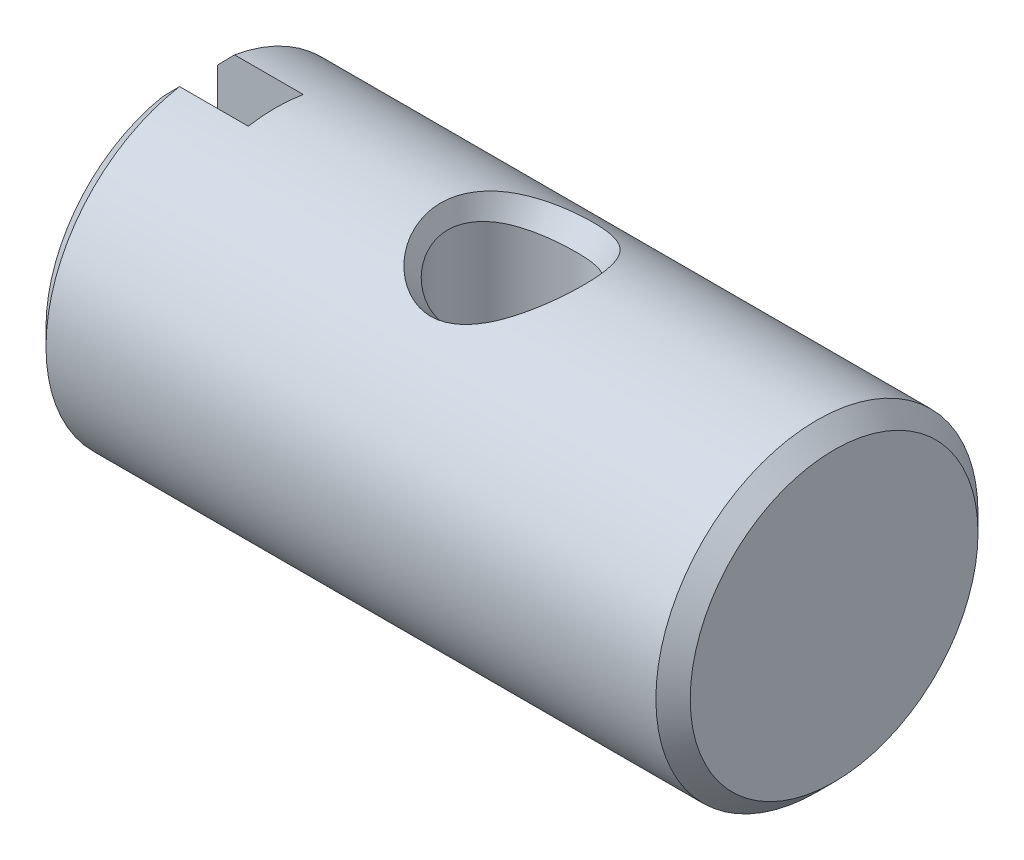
ISO-10303-21;
HEADER;
FILE_DESCRIPTION(('STEP AP214'),'2;1');
FILE_NAME('part.step','',(''),(''),'','','');
FILE_SCHEMA(('AUTOMOTIVE_DESIGN { 1 0 10303 214 1 1 1 1 }'));
ENDSEC;
DATA;
#1=APPLICATION_CONTEXT('core data for automotive mechanical design processes');
#2=APPLICATION_PROTOCOL_DEFINITION('international standard','automotive_design',2000,#1);
#3=PRODUCT_CONTEXT('',#1,'mechanical');
#4=PRODUCT('Part','Part','',(#3));
#5=PRODUCT_RELATED_PRODUCT_CATEGORY('part','',(#4));
#6=PRODUCT_DEFINITION_FORMATION('','',#4);
#7=PRODUCT_DEFINITION_CONTEXT('part definition',#1,'design');
#8=PRODUCT_DEFINITION('design','',#6,#7);
#9=PRODUCT_DEFINITION_SHAPE('','',#8);
#10=(LENGTH_UNIT() NAMED_UNIT(*) SI_UNIT(.MILLI.,.METRE.));
#11=(NAMED_UNIT(*) PLANE_ANGLE_UNIT() SI_UNIT($,.RADIAN.));
#12=(NAMED_UNIT(*) SI_UNIT($,.STERADIAN.) SOLID_ANGLE_UNIT());
#13=UNCERTAINTY_MEASURE_WITH_UNIT(LENGTH_MEASURE(1.E-05),#10,'distance_accuracy_value','');
#14=(GEOMETRIC_REPRESENTATION_CONTEXT(3) GLOBAL_UNCERTAINTY_ASSIGNED_CONTEXT((#13)) GLOBAL_UNIT_ASSIGNED_CONTEXT((#10,
#11,#12)) REPRESENTATION_CONTEXT('',''));
#15=CARTESIAN_POINT('',(0.,0.,0.));
#16=DIRECTION('',(0.,0.,1.));
#17=DIRECTION('',(1.,0.,0.));
#18=AXIS2_PLACEMENT_3D('',#15,#16,#17);
#19=CARTESIAN_POINT('',(0.,0.,0.));
#20=DIRECTION('',(1.,0.,0.));
#21=DIRECTION('',(0.,0.,-1.));
#22=AXIS2_PLACEMENT_3D('',#19,#20,#21);
#23=PLANE('',#22);
#24=CARTESIAN_POINT('',(0.,0.,0.));
#25=DIRECTION('',(1.,0.,0.));
#26=DIRECTION('',(0.,0.,-1.));
#27=AXIS2_PLACEMENT_3D('',#24,#25,#26);
#28=CIRCLE('',#27,4.25449999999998);
#29=CARTESIAN_POINT('',(0.,-4.17613773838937,0.812800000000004));
#30=VERTEX_POINT('',#29);
#31=CARTESIAN_POINT('',(0.,4.17613773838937,0.812800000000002));
#32=VERTEX_POINT('',#31);
#33=EDGE_CURVE('E108',#30,#32,#28,.F.);
#34=ORIENTED_EDGE('',*,*,#33,.T.);
#35=DIRECTION('',(0.,1.,0.));
#36=VECTOR('',#35,1.);
#37=CARTESIAN_POINT('',(0.,4.94340203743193,0.812800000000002));
#38=LINE('',#37,#36);
#39=EDGE_CURVE('E97',#30,#32,#38,.T.);
#40=ORIENTED_EDGE('',*,*,#39,.F.);
#41=EDGE_LOOP('',(#34,#40));
#42=FACE_BOUND('',#41,.T.);
#43=ADVANCED_FACE('F38',(#42),#23,.F.);
#44=CARTESIAN_POINT('',(0.508000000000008,0.,0.));
#45=DIRECTION('',(1.,0.,0.));
#46=DIRECTION('',(0.,0.,-1.));
#47=AXIS2_PLACEMENT_3D('',#44,#45,#46);
#48=CONICAL_SURFACE('',#47,4.7625,0.785398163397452);
#49=CARTESIAN_POINT('',(6.23132222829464,-10.4542730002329,0.812800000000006));
#50=CARTESIAN_POINT('',(5.86145033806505,-10.0832750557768,0.812800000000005));
#51=CARTESIAN_POINT('',(5.49162846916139,-9.71222718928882,0.812800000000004));
#52=CARTESIAN_POINT('',(4.75213851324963,-8.96994865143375,0.812800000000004));
#53=CARTESIAN_POINT('',(4.38247043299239,-8.5987179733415,0.812800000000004));
#54=CARTESIAN_POINT('',(3.64301362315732,-7.85566100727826,0.812800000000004));
#55=CARTESIAN_POINT('',(3.27322512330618,-7.48383449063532,0.812800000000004));
#56=CARTESIAN_POINT('',(2.53403120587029,-6.73982959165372,0.812800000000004));
#57=CARTESIAN_POINT('',(2.16462577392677,-6.36765122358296,0.812800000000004));
#58=CARTESIAN_POINT('',(1.4437113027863,-5.64014970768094,0.812800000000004));
#59=CARTESIAN_POINT('',(1.0921747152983,-5.284853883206,0.812800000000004));
#60=CARTESIAN_POINT('',(0.565593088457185,-4.75115481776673,0.812800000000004));
#61=CARTESIAN_POINT('',(0.390176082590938,-4.57311870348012,0.812800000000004));
#62=CARTESIAN_POINT('',(0.0396986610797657,-4.21669962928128,0.812800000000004));
#63=CARTESIAN_POINT('',(-0.135361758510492,-4.03831667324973,0.812800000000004));
#64=CARTESIAN_POINT('',(-0.484864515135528,-3.68115063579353,0.812800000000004));
#65=CARTESIAN_POINT('',(-0.659307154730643,-3.50236785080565,0.812800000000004));
#66=CARTESIAN_POINT('',(-1.00739844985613,-3.14401592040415,0.812800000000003));
#67=CARTESIAN_POINT('',(-1.18104707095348,-2.96444674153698,0.812800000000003));
#68=CARTESIAN_POINT('',(-1.5269980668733,-2.60408106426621,0.812800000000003));
#69=CARTESIAN_POINT('',(-1.69930071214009,-2.42328482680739,0.812800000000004));
#70=CARTESIAN_POINT('',(-1.9558788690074,-2.15033712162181,0.812800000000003));
#71=CARTESIAN_POINT('',(-2.04108939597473,-2.05906548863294,0.812800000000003));
#72=CARTESIAN_POINT('',(-2.210592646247,-1.87567476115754,0.812800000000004));
#73=CARTESIAN_POINT('',(-2.29488539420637,-1.78355568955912,0.812800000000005));
#74=CARTESIAN_POINT('',(-2.40171687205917,-1.66501758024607,0.812800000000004));
#75=CARTESIAN_POINT('',(-2.424902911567,-1.63918177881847,0.812800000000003));
#76=CARTESIAN_POINT('',(-2.47114943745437,-1.58739773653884,0.812800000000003));
#77=CARTESIAN_POINT('',(-2.49420992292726,-1.56144949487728,0.812800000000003));
#78=CARTESIAN_POINT('',(-2.5631820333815,-1.48341054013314,0.812800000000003));
#79=CARTESIAN_POINT('',(-2.60887999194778,-1.43113037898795,0.812800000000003));
#80=CARTESIAN_POINT('',(-2.69986547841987,-1.32550774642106,0.812800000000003));
#81=CARTESIAN_POINT('',(-2.74514711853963,-1.27216019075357,0.812800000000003));
#82=CARTESIAN_POINT('',(-2.8346338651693,-1.16458942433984,0.812800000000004));
#83=CARTESIAN_POINT('',(-2.87883925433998,-1.11036644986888,0.812800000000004));
#84=CARTESIAN_POINT('',(-2.96607937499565,-1.00026244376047,0.812800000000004));
#85=CARTESIAN_POINT('',(-3.00910170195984,-0.944371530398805,0.812800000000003));
#86=CARTESIAN_POINT('',(-3.09287785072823,-0.830782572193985,0.812800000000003));
#87=CARTESIAN_POINT('',(-3.13362880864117,-0.773082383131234,0.812800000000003));
#88=CARTESIAN_POINT('',(-3.21115619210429,-0.655641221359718,0.812800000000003));
#89=CARTESIAN_POINT('',(-3.24795908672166,-0.595917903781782,0.812800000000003));
#90=CARTESIAN_POINT('',(-3.31542555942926,-0.473120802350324,0.812800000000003));
#91=CARTESIAN_POINT('',(-3.34610636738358,-0.410057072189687,0.812800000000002));
#92=CARTESIAN_POINT('',(-3.3811354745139,-0.320354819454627,0.812800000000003));
#93=CARTESIAN_POINT('',(-3.38998579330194,-0.295482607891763,0.812800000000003));
#94=CARTESIAN_POINT('',(-3.40586952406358,-0.24515529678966,0.812800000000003));
#95=CARTESIAN_POINT('',(-3.41290287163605,-0.21970017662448,0.812800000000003));
#96=CARTESIAN_POINT('',(-3.4248134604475,-0.168389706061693,0.812800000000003));
#97=CARTESIAN_POINT('',(-3.4296991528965,-0.142536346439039,0.812800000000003));
#98=CARTESIAN_POINT('',(-3.43708352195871,-0.0904923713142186,0.812800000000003));
#99=CARTESIAN_POINT('',(-3.43958285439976,-0.0643018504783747,0.812800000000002));
#100=CARTESIAN_POINT('',(-3.44204668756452,-0.0115880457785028,0.812800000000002));
#101=CARTESIAN_POINT('',(-3.44199071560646,0.0149362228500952,0.812800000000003));
#102=CARTESIAN_POINT('',(-3.43930275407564,0.0678477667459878,0.812800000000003));
#103=CARTESIAN_POINT('',(-3.43667072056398,0.0942350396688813,0.812800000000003));
#104=CARTESIAN_POINT('',(-3.42511377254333,0.172986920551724,0.812800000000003));
#105=CARTESIAN_POINT('',(-3.4125237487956,0.224828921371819,0.812800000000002));
#106=CARTESIAN_POINT('',(-3.3807207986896,0.324026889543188,0.812800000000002));
#107=CARTESIAN_POINT('',(-3.36178803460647,0.371479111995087,0.812800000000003));
#108=CARTESIAN_POINT('',(-3.31933152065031,0.464326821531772,0.812800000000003));
#109=CARTESIAN_POINT('',(-3.29580011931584,0.509718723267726,0.812800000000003));
#110=CARTESIAN_POINT('',(-3.24544714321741,0.599098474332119,0.812800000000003));
#111=CARTESIAN_POINT('',(-3.21859995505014,0.643071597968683,0.812800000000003));
#112=CARTESIAN_POINT('',(-3.16278238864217,0.729583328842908,0.812800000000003));
#113=CARTESIAN_POINT('',(-3.13381370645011,0.772123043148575,0.812800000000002));
#114=CARTESIAN_POINT('',(-3.07195064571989,0.859540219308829,0.812800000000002));
#115=CARTESIAN_POINT('',(-3.03892856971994,0.904326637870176,0.812800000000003));
#116=CARTESIAN_POINT('',(-2.97162680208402,0.992947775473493,0.812800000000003));
#117=CARTESIAN_POINT('',(-2.93734693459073,1.0367823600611,0.812800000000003));
#118=CARTESIAN_POINT('',(-2.83311516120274,1.16724300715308,0.812800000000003));
#119=CARTESIAN_POINT('',(-2.76180465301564,1.25278015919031,0.812800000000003));
#120=CARTESIAN_POINT('',(-2.61698200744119,1.42222639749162,0.812800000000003));
#121=CARTESIAN_POINT('',(-2.54346595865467,1.50613209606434,0.812800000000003));
#122=CARTESIAN_POINT('',(-2.39513110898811,1.67273590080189,0.812800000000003));
#123=CARTESIAN_POINT('',(-2.32031271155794,1.75543436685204,0.812800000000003));
#124=CARTESIAN_POINT('',(-2.16999515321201,1.9197950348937,0.812800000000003));
#125=CARTESIAN_POINT('',(-2.09449839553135,2.00145944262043,0.812800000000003));
#126=CARTESIAN_POINT('',(-1.94287787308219,2.16421498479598,0.812800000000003));
#127=CARTESIAN_POINT('',(-1.86675406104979,2.2453060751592,0.812800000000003));
#128=CARTESIAN_POINT('',(-1.7141418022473,2.40696595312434,0.812800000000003));
#129=CARTESIAN_POINT('',(-1.63765388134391,2.48753523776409,0.812800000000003));
#130=CARTESIAN_POINT('',(-1.48433854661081,2.64834591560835,0.812800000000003));
#131=CARTESIAN_POINT('',(-1.40751114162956,2.72858731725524,0.812800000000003));
#132=CARTESIAN_POINT('',(-1.17487364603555,2.97077498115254,0.812800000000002));
#133=CARTESIAN_POINT('',(-1.01866179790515,3.13233518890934,0.812800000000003));
#134=CARTESIAN_POINT('',(-0.70557220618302,3.45480943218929,0.812800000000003));
#135=CARTESIAN_POINT('',(-0.548694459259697,3.61572346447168,0.812800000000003));
#136=CARTESIAN_POINT('',(-0.0773968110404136,4.09782947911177,0.812800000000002));
#137=CARTESIAN_POINT('',(0.237680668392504,4.41837831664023,0.812800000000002));
#138=CARTESIAN_POINT('',(0.868894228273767,5.0587892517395,0.812800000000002));
#139=CARTESIAN_POINT('',(1.18503080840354,5.37865085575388,0.812800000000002));
#140=CARTESIAN_POINT('',(1.81782538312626,6.01785113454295,0.812800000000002));
#141=CARTESIAN_POINT('',(2.13448337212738,6.33718981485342,0.812800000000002));
#142=CARTESIAN_POINT('',(2.76598164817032,6.97337655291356,0.812800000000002));
#143=CARTESIAN_POINT('',(3.08081970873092,7.29022682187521,0.812800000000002));
#144=CARTESIAN_POINT('',(3.71071725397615,7.92370942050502,0.812800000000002));
#145=CARTESIAN_POINT('',(4.02577673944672,8.24034174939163,0.812800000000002));
#146=CARTESIAN_POINT('',(4.65585365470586,8.8732551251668,0.812800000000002));
#147=CARTESIAN_POINT('',(4.97087098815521,9.1895362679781,0.812800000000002));
#148=CARTESIAN_POINT('',(5.60102011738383,9.82198208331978,0.812800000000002));
#149=CARTESIAN_POINT('',(5.91615191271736,10.1381467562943,0.812800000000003));
#150=CARTESIAN_POINT('',(6.23132222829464,10.4542730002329,0.812800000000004));
#151=B_SPLINE_CURVE_WITH_KNOTS('',3,(#49,#50,#51,#52,#53,#54,#55,#56,#57,#58,#59,#60,#61,#62,
#63,#64,#65,#66,#67,#68,#69,#70,#71,#72,#73,#74,#75,#76,#77,#78,#79,#80,#81,#82,#83,#84,#85,#86,
#87,#88,#89,#90,#91,#92,#93,#94,#95,#96,#97,#98,#99,#100,#101,#102,#103,#104,#105,#106,#107,
#108,#109,#110,#111,#112,#113,#114,#115,#116,#117,#118,#119,#120,#121,#122,#123,#124,#125,#126,
#127,#128,#129,#130,#131,#132,#133,#134,#135,#136,#137,#138,#139,#140,#141,#142,#143,#144,#145,
#146,#147,#148,#149,#150),.UNSPECIFIED.,.F.,.F.,(4,2,2,2,2,2,2,2,2,2,2,2,2,2,2,2,2,2,2,2,2,2,2,
2,2,2,2,2,2,2,2,2,2,2,2,2,2,2,2,2,2,2,2,2,2,2,2,2,2,2,4),(0.,1.57162411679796,3.14331116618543,
4.71651994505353,6.28966745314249,7.78910533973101,8.53891286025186,9.28871203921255,
10.0380709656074,10.7874620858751,11.5366985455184,11.9112910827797,12.2858735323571,
12.3900160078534,12.4941592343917,12.7024650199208,12.9123781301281,13.1222355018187,
13.3337951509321,13.5456157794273,13.755913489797,13.9656107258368,14.0447544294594,
14.1239009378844,14.2027331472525,14.2815436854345,14.3609857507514,14.4404291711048,
14.5996486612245,14.752601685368,14.9058114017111,15.0602888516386,15.2146441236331,
15.381546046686,15.548471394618,15.8824922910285,16.2171453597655,16.5516965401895,
16.885338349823,17.2190055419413,17.5522853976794,17.885556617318,18.5597447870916,
19.2339363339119,20.582348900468,21.9315274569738,23.2806916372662,24.6207116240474,
25.9607363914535,27.2999253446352,28.6391091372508),.UNSPECIFIED.);
#152=CARTESIAN_POINT('',(0.508000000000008,-4.69262851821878,0.812800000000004));
#153=VERTEX_POINT('',#152);
#154=EDGE_CURVE('E94',#153,#30,#151,.T.);
#155=ORIENTED_EDGE('',*,*,#154,.F.);
#156=CARTESIAN_POINT('',(0.508000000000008,0.,0.));
#157=DIRECTION('',(1.,0.,0.));
#158=DIRECTION('',(0.,0.,-1.));
#159=AXIS2_PLACEMENT_3D('',#156,#157,#158);
#160=CIRCLE('',#159,4.7625);
#161=CARTESIAN_POINT('',(0.508000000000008,4.69262851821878,0.812800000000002));
#162=VERTEX_POINT('',#161);
#163=EDGE_CURVE('E118',#162,#153,#160,.T.);
#164=ORIENTED_EDGE('',*,*,#163,.F.);
#165=EDGE_CURVE('E104',#32,#162,#151,.T.);
#166=ORIENTED_EDGE('',*,*,#165,.F.);
#167=ORIENTED_EDGE('',*,*,#33,.F.);
#168=EDGE_LOOP('',(#155,#164,#166,#167));
#169=FACE_BOUND('',#168,.T.);
#170=ADVANCED_FACE('F110',(#169),#48,.T.);
#171=CARTESIAN_POINT('',(19.05,0.,0.));
#172=DIRECTION('',(-1.,0.,0.));
#173=DIRECTION('',(0.,0.,1.));
#174=AXIS2_PLACEMENT_3D('',#171,#172,#173);
#175=CYLINDRICAL_SURFACE('',#174,4.7625);
#176=CARTESIAN_POINT('',(9.52500000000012,-4.11115054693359,2.40413132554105));
#177=CARTESIAN_POINT('',(9.50734473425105,-4.111157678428,2.40411404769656));
#178=CARTESIAN_POINT('',(9.48969005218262,-4.11132807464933,2.4038368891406));
#179=CARTESIAN_POINT('',(9.45443802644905,-4.11198603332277,2.40276752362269));
#180=CARTESIAN_POINT('',(9.43684063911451,-4.11247295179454,2.40197636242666));
#181=CARTESIAN_POINT('',(9.40171142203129,-4.11375382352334,2.39988502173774));
#182=CARTESIAN_POINT('',(9.38417953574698,-4.11454735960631,2.39858553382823));
#183=CARTESIAN_POINT('',(9.3491893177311,-4.11643109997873,2.39548393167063));
#184=CARTESIAN_POINT('',(9.33173094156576,-4.11752108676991,2.39368218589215));
#185=CARTESIAN_POINT('',(9.29689576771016,-4.11998746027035,2.38958232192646));
#186=CARTESIAN_POINT('',(9.27951895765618,-4.12136380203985,2.38728428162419));
#187=CARTESIAN_POINT('',(9.24485491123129,-4.12439262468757,2.38219807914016));
#188=CARTESIAN_POINT('',(9.22756771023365,-4.12604520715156,2.37940973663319));
#189=CARTESIAN_POINT('',(9.19309085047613,-4.12961628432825,2.37334913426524));
#190=CARTESIAN_POINT('',(9.17590128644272,-4.13153500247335,2.37007646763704));
#191=CARTESIAN_POINT('',(9.14162771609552,-4.13562813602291,2.36305341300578));
#192=CARTESIAN_POINT('',(9.12454387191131,-4.13780287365,2.3593024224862));
#193=CARTESIAN_POINT('',(9.09048953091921,-4.14239789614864,2.35132880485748));
#194=CARTESIAN_POINT('',(9.07351926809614,-4.14481858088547,2.34710540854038));
#195=CARTESIAN_POINT('',(9.03970069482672,-4.14989521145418,2.33819333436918));
#196=CARTESIAN_POINT('',(9.02285269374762,-4.15255161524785,2.33350374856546));
#197=CARTESIAN_POINT('',(8.97244197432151,-4.16086875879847,2.31872789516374));
#198=CARTESIAN_POINT('',(8.93913005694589,-4.16686143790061,2.30796212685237));
#199=CARTESIAN_POINT('',(8.87308948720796,-4.17966408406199,2.28464674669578));
#200=CARTESIAN_POINT('',(8.84036502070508,-4.18647834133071,2.27208770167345));
#201=CARTESIAN_POINT('',(8.7755592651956,-4.20084373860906,2.24523369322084));
#202=CARTESIAN_POINT('',(8.74348310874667,-4.20839911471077,2.23092862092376));
#203=CARTESIAN_POINT('',(8.68003799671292,-4.22416608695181,2.20063090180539));
#204=CARTESIAN_POINT('',(8.64867494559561,-4.23238160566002,2.18462795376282));
#205=CARTESIAN_POINT('',(8.58671923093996,-4.24938860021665,2.15098211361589));
#206=CARTESIAN_POINT('',(8.55613302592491,-4.25818352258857,2.13332908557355));
#207=CARTESIAN_POINT('',(8.49579470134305,-4.27626909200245,2.09643043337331));
#208=CARTESIAN_POINT('',(8.46604939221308,-4.2855626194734,2.07717509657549));
#209=CARTESIAN_POINT('',(8.40745670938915,-4.30456548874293,2.03711900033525));
#210=CARTESIAN_POINT('',(8.37861631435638,-4.31427711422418,2.01630912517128));
#211=CARTESIAN_POINT('',(8.32189746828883,-4.33403536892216,1.97319066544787));
#212=CARTESIAN_POINT('',(8.29402600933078,-4.34408368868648,1.95087366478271));
#213=CARTESIAN_POINT('',(8.23930939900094,-4.36443794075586,1.90478873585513));
#214=CARTESIAN_POINT('',(8.21247113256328,-4.37474502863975,1.88101314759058));
#215=CARTESIAN_POINT('',(8.15988464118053,-4.39552642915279,1.83205440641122));
#216=CARTESIAN_POINT('',(8.13414310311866,-4.40600134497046,1.80686433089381));
#217=CARTESIAN_POINT('',(8.08381673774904,-4.42707668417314,1.75513644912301));
#218=CARTESIAN_POINT('',(8.05923836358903,-4.43767747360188,1.72859251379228));
#219=CARTESIAN_POINT('',(8.01126277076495,-4.45879341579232,1.67411898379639));
#220=CARTESIAN_POINT('',(7.98787346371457,-4.46930768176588,1.64618207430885));
#221=CARTESIAN_POINT('',(7.94227738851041,-4.49006179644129,1.58892184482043));
#222=CARTESIAN_POINT('',(7.92007984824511,-4.50029926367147,1.55959031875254));
#223=CARTESIAN_POINT('',(7.87691388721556,-4.52047925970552,1.49963355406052));
#224=CARTESIAN_POINT('',(7.85595419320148,-4.53041949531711,1.46900126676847));
#225=CARTESIAN_POINT('',(7.81530799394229,-4.54993492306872,1.40651926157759));
#226=CARTESIAN_POINT('',(7.79562960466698,-4.55950765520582,1.37466349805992));
#227=CARTESIAN_POINT('',(7.75759089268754,-4.5782312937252,1.30981532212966));
#228=CARTESIAN_POINT('',(7.73923802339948,-4.58737972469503,1.2768178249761));
#229=CARTESIAN_POINT('',(7.70389509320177,-4.60519428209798,1.20976583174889));
#230=CARTESIAN_POINT('',(7.6869117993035,-4.61385795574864,1.17570711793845));
#231=CARTESIAN_POINT('',(7.65435283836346,-4.63064344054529,1.106612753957));
#232=CARTESIAN_POINT('',(7.63878326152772,-4.63876287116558,1.07157365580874));
#233=CARTESIAN_POINT('',(7.60909653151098,-4.65440000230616,1.00059859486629));
#234=CARTESIAN_POINT('',(7.59498483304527,-4.66191542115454,0.96465984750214));
#235=CARTESIAN_POINT('',(7.56825861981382,-4.67628470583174,0.891965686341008));
#236=CARTESIAN_POINT('',(7.55564899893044,-4.68313639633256,0.855208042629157));
#237=CARTESIAN_POINT('',(7.53197162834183,-4.69611837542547,0.780956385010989));
#238=CARTESIAN_POINT('',(7.52090832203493,-4.70224657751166,0.743460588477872));
#239=CARTESIAN_POINT('',(7.50036814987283,-4.71372176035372,0.667813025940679));
#240=CARTESIAN_POINT('',(7.49089542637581,-4.71906669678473,0.629659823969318));
#241=CARTESIAN_POINT('',(7.47358086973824,-4.72891556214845,0.552777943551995));
#242=CARTESIAN_POINT('',(7.46574307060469,-4.73341740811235,0.514048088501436));
#243=CARTESIAN_POINT('',(7.45174250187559,-4.74152045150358,0.436093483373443));
#244=CARTESIAN_POINT('',(7.4455838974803,-4.74511940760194,0.396867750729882));
#245=CARTESIAN_POINT('',(7.43498604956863,-4.75135693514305,0.318002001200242));
#246=CARTESIAN_POINT('',(7.43055139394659,-4.75399294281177,0.278361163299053));
#247=CARTESIAN_POINT('',(7.42344385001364,-4.75824583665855,0.198745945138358));
#248=CARTESIAN_POINT('',(7.42077631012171,-4.75985962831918,0.158770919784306));
#249=CARTESIAN_POINT('',(7.41725116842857,-4.76200646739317,0.0785676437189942));
#250=CARTESIAN_POINT('',(7.4164000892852,-4.76253561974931,0.038338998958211));
#251=CARTESIAN_POINT('',(7.4165324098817,-4.7624636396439,-0.0421055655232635));
#252=CARTESIAN_POINT('',(7.41751543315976,-4.76186273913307,-0.0823214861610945));
#253=CARTESIAN_POINT('',(7.42127094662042,-4.75958950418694,-0.162477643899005));
#254=CARTESIAN_POINT('',(7.42403629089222,-4.75792144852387,-0.202418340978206));
#255=CARTESIAN_POINT('',(7.43131829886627,-4.75357101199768,-0.281946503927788));
#256=CARTESIAN_POINT('',(7.43582898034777,-4.7508920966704,-0.321534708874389));
#257=CARTESIAN_POINT('',(7.44655779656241,-4.74457987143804,-0.400280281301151));
#258=CARTESIAN_POINT('',(7.45277077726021,-4.74094944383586,-0.439438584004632));
#259=CARTESIAN_POINT('',(7.46686231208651,-4.7327930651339,-0.517246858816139));
#260=CARTESIAN_POINT('',(7.47473621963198,-4.72826961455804,-0.555897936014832));
#261=CARTESIAN_POINT('',(7.49210760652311,-4.71838609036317,-0.632614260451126));
#262=CARTESIAN_POINT('',(7.5016006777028,-4.71302829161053,-0.670680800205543));
#263=CARTESIAN_POINT('',(7.52216877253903,-4.70153476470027,-0.746150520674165));
#264=CARTESIAN_POINT('',(7.53323940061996,-4.69540120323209,-0.783555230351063));
#265=CARTESIAN_POINT('',(7.55692118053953,-4.68241474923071,-0.857623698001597));
#266=CARTESIAN_POINT('',(7.56952776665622,-4.67556399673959,-0.894289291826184));
#267=CARTESIAN_POINT('',(7.59624022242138,-4.66120168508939,-0.966801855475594));
#268=CARTESIAN_POINT('',(7.61034121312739,-4.65369228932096,-1.00265105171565));
#269=CARTESIAN_POINT('',(7.64000137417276,-4.63807115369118,-1.07345305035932));
#270=CARTESIAN_POINT('',(7.65555524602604,-4.62996162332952,-1.10840856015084));
#271=CARTESIAN_POINT('',(7.68808017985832,-4.6131987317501,-1.17734533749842));
#272=CARTESIAN_POINT('',(7.70504545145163,-4.60454762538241,-1.21132988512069));
#273=CARTESIAN_POINT('',(7.74035223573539,-4.58675984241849,-1.27824672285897));
#274=CARTESIAN_POINT('',(7.7586874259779,-4.57762544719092,-1.3111829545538));
#275=CARTESIAN_POINT('',(7.79669325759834,-4.55893032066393,-1.37592531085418));
#276=CARTESIAN_POINT('',(7.81635703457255,-4.54937185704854,-1.40773611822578));
#277=CARTESIAN_POINT('',(7.8569788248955,-4.52988433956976,-1.47014873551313));
#278=CARTESIAN_POINT('',(7.87792945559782,-4.519957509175,-1.50075604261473));
#279=CARTESIAN_POINT('',(7.92108533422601,-4.49980210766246,-1.56068624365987));
#280=CARTESIAN_POINT('',(7.9432827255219,-4.4895755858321,-1.59001547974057));
#281=CARTESIAN_POINT('',(7.98888648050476,-4.46884139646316,-1.64730095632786));
#282=CARTESIAN_POINT('',(8.01228463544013,-4.45833582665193,-1.67526448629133));
#283=CARTESIAN_POINT('',(8.06028840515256,-4.4372331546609,-1.72980358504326));
#284=CARTESIAN_POINT('',(8.08488666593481,-4.42663687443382,-1.75638594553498));
#285=CARTESIAN_POINT('',(8.13526411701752,-4.40556605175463,-1.80818129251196));
#286=CARTESIAN_POINT('',(8.16103688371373,-4.39509116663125,-1.83340038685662));
#287=CARTESIAN_POINT('',(8.21369395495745,-4.37430756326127,-1.88241039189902));
#288=CARTESIAN_POINT('',(8.24057161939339,-4.36399825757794,-1.90620818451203));
#289=CARTESIAN_POINT('',(8.29537512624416,-4.34363783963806,-1.95232979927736));
#290=CARTESIAN_POINT('',(8.32329413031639,-4.33358559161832,-1.97466124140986));
#291=CARTESIAN_POINT('',(8.38011530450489,-4.31381873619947,-2.01780085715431));
#292=CARTESIAN_POINT('',(8.40901053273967,-4.30410245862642,-2.03861740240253));
#293=CARTESIAN_POINT('',(8.46771948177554,-4.28509040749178,-2.07867885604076));
#294=CARTESIAN_POINT('',(8.49752627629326,-4.27579237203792,-2.09793283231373));
#295=CARTESIAN_POINT('',(8.55799347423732,-4.25769880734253,-2.13482059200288));
#296=CARTESIAN_POINT('',(8.58864712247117,-4.24890042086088,-2.152464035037));
#297=CARTESIAN_POINT('',(8.65074294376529,-4.23188840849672,-2.18608232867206));
#298=CARTESIAN_POINT('',(8.68217871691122,-4.22367136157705,-2.20206725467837));
#299=CARTESIAN_POINT('',(8.74577380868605,-4.20790413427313,-2.23232035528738));
#300=CARTESIAN_POINT('',(8.77792728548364,-4.20035006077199,-2.24659875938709));
#301=CARTESIAN_POINT('',(8.84289152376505,-4.18599095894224,-2.27339066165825));
#302=CARTESIAN_POINT('',(8.87569721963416,-4.17918173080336,-2.28591418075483));
#303=CARTESIAN_POINT('',(8.94190343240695,-4.16639371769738,-2.3091495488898));
#304=CARTESIAN_POINT('',(8.97529983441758,-4.16041068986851,-2.31987072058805));
#305=CARTESIAN_POINT('',(9.02583789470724,-4.15211235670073,-2.33457235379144));
#306=CARTESIAN_POINT('',(9.04272904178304,-4.14946283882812,-2.33923618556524));
#307=CARTESIAN_POINT('',(9.07663445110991,-4.14440145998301,-2.34809442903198));
#308=CARTESIAN_POINT('',(9.09364841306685,-4.14198915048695,-2.35228972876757));
#309=CARTESIAN_POINT('',(9.1277906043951,-4.13741246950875,-2.36020480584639));
#310=CARTESIAN_POINT('',(9.14491860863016,-4.13524770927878,-2.36392532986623));
#311=CARTESIAN_POINT('',(9.17928086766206,-4.13117623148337,-2.37088508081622));
#312=CARTESIAN_POINT('',(9.19651496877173,-4.12926920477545,-2.37412488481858));
#313=CARTESIAN_POINT('',(9.23108118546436,-4.12572332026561,-2.38011736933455));
#314=CARTESIAN_POINT('',(9.24841321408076,-4.12408425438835,-2.38287042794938));
#315=CARTESIAN_POINT('',(9.28316711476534,-4.12108438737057,-2.38788364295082));
#316=CARTESIAN_POINT('',(9.3005889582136,-4.11972350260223,-2.39014394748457));
#317=CARTESIAN_POINT('',(9.33551430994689,-4.11729006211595,-2.39416591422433));
#318=CARTESIAN_POINT('',(9.35301783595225,-4.11621757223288,-2.39592746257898));
#319=CARTESIAN_POINT('',(9.38809839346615,-4.11437099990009,-2.39894616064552));
#320=CARTESIAN_POINT('',(9.40567547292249,-4.11359715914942,-2.40020290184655));
#321=CARTESIAN_POINT('',(9.44089498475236,-4.11235778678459,-2.40220644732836));
#322=CARTESIAN_POINT('',(9.45853747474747,-4.11189269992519,-2.40295251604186));
#323=CARTESIAN_POINT('',(9.49387970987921,-4.11128127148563,-2.40392851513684));
#324=CARTESIAN_POINT('',(9.5115794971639,-4.11113560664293,-2.40415734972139));
#325=CARTESIAN_POINT('',(9.5469739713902,-4.11117127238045,-2.4040954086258));
#326=CARTESIAN_POINT('',(9.56466865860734,-4.11135253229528,-2.40380474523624));
#327=CARTESIAN_POINT('',(9.59999098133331,-4.11203194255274,-2.40270909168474));
#328=CARTESIAN_POINT('',(9.61761867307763,-4.11252928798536,-2.40190540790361));
#329=CARTESIAN_POINT('',(9.65279941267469,-4.11383094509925,-2.39978945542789));
#330=CARTESIAN_POINT('',(9.6703525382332,-4.11463468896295,-2.3984781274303));
#331=CARTESIAN_POINT('',(9.7053765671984,-4.11653868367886,-2.39535329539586));
#332=CARTESIAN_POINT('',(9.7228475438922,-4.11763857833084,-2.39354039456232));
#333=CARTESIAN_POINT('',(9.75769972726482,-4.12012459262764,-2.38941860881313));
#334=CARTESIAN_POINT('',(9.77508098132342,-4.12151054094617,-2.38711002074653));
#335=CARTESIAN_POINT('',(9.80974618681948,-4.12455836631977,-2.38200307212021));
#336=CARTESIAN_POINT('',(9.82703014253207,-4.12622023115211,-2.37920473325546));
#337=CARTESIAN_POINT('',(9.86149325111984,-4.12980963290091,-2.37312444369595));
#338=CARTESIAN_POINT('',(9.87867235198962,-4.13173729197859,-2.36984227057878));
#339=CARTESIAN_POINT('',(9.91291820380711,-4.13584803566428,-2.36280046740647));
#340=CARTESIAN_POINT('',(9.92998483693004,-4.13803135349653,-2.3590404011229));
#341=CARTESIAN_POINT('',(9.96399843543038,-4.14264323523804,-2.35104885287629));
#342=CARTESIAN_POINT('',(9.98094521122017,-4.1450721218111,-2.34681674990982));
#343=CARTESIAN_POINT('',(10.0147109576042,-4.15016482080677,-2.33788744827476));
#344=CARTESIAN_POINT('',(10.0315296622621,-4.15282902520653,-2.33318947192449));
#345=CARTESIAN_POINT('',(10.0818384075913,-4.16116808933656,-2.31839034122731));
#346=CARTESIAN_POINT('',(10.1150763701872,-4.16717508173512,-2.30760865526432));
#347=CARTESIAN_POINT('',(10.1809511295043,-4.18000489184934,-2.2842612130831));
#348=CARTESIAN_POINT('',(10.2135840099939,-4.18683170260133,-2.27168666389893));
#349=CARTESIAN_POINT('',(10.2781925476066,-4.20122045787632,-2.24480120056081));
#350=CARTESIAN_POINT('',(10.3101632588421,-4.20878645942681,-2.23048058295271));
#351=CARTESIAN_POINT('',(10.3733872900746,-4.22457267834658,-2.2001510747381));
#352=CARTESIAN_POINT('',(10.4046347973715,-4.23279672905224,-2.18413208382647));
#353=CARTESIAN_POINT('',(10.4663531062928,-4.24981855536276,-2.15045317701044));
#354=CARTESIAN_POINT('',(10.4968174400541,-4.25861975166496,-2.13278315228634));
#355=CARTESIAN_POINT('',(10.5569095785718,-4.27671543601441,-2.09584921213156));
#356=CARTESIAN_POINT('',(10.5865304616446,-4.286012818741,-2.07657546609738));
#357=CARTESIAN_POINT('',(10.6448757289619,-4.3050207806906,-2.03648091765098));
#358=CARTESIAN_POINT('',(10.6735929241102,-4.31473367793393,-2.0156507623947));
#359=CARTESIAN_POINT('',(10.730070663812,-4.33449171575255,-1.97248973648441));
#360=CARTESIAN_POINT('',(10.7578239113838,-4.34453858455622,-1.95015011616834));
#361=CARTESIAN_POINT('',(10.8123133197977,-4.36488695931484,-1.90401758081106));
#362=CARTESIAN_POINT('',(10.8390422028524,-4.37518964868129,-1.88021659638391));
#363=CARTESIAN_POINT('',(10.8914227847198,-4.39595939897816,-1.83120419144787));
#364=CARTESIAN_POINT('',(10.9170673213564,-4.40642706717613,-1.80598537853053));
#365=CARTESIAN_POINT('',(10.9672172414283,-4.42748399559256,-1.75419710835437));
#366=CARTESIAN_POINT('',(10.9917156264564,-4.43807360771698,-1.72762101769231));
#367=CARTESIAN_POINT('',(11.0395463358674,-4.45916524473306,-1.67308178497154));
#368=CARTESIAN_POINT('',(11.0628703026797,-4.46966629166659,-1.64511093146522));
#369=CARTESIAN_POINT('',(11.1083442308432,-4.49039452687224,-1.58778299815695));
#370=CARTESIAN_POINT('',(11.1304846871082,-4.500619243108,-1.55841749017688));
#371=CARTESIAN_POINT('',(11.17354527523,-4.52077356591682,-1.49839387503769));
#372=CARTESIAN_POINT('',(11.1944564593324,-4.53070079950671,-1.46772855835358));
#373=CARTESIAN_POINT('',(11.2350135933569,-4.55019046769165,-1.40518206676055));
#374=CARTESIAN_POINT('',(11.2546512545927,-4.55975037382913,-1.37329473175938));
#375=CARTESIAN_POINT('',(11.2926159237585,-4.5784487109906,-1.30838558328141));
#376=CARTESIAN_POINT('',(11.3109353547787,-4.58758461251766,-1.27535861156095));
#377=CARTESIAN_POINT('',(11.3462182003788,-4.60537464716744,-1.20825040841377));
#378=CARTESIAN_POINT('',(11.3631747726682,-4.61402629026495,-1.17416492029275));
#379=CARTESIAN_POINT('',(11.3956864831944,-4.63078841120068,-1.10502033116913));
#380=CARTESIAN_POINT('',(11.4112355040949,-4.63889649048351,-1.06995777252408));
#381=CARTESIAN_POINT('',(11.440886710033,-4.65451178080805,-0.99893970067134));
#382=CARTESIAN_POINT('',(11.4549834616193,-4.66201671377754,-0.962981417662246));
#383=CARTESIAN_POINT('',(11.4816847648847,-4.67636604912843,-0.890252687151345));
#384=CARTESIAN_POINT('',(11.4942844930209,-4.68320830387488,-0.853480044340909));
#385=CARTESIAN_POINT('',(11.5179464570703,-4.69617259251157,-0.779203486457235));
#386=CARTESIAN_POINT('',(11.5290043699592,-4.70229259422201,-0.741697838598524));
#387=CARTESIAN_POINT('',(11.5495375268,-4.71375271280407,-0.666036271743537));
#388=CARTESIAN_POINT('',(11.5590087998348,-4.71909086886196,-0.627878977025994));
#389=CARTESIAN_POINT('',(11.5763236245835,-4.7289276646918,-0.550995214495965));
#390=CARTESIAN_POINT('',(11.5841633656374,-4.73342433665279,-0.512267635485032));
#391=CARTESIAN_POINT('',(11.5981703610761,-4.74151866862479,-0.434324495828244));
#392=CARTESIAN_POINT('',(11.6043337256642,-4.74511423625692,-0.395108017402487));
#393=CARTESIAN_POINT('',(11.6149430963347,-4.75134679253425,-0.316268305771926));
#394=CARTESIAN_POINT('',(11.6193848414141,-4.75398140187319,-0.276644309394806));
#395=CARTESIAN_POINT('',(11.626507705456,-4.75823337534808,-0.197070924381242));
#396=CARTESIAN_POINT('',(11.6291838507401,-4.75984786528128,-0.157120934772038));
#397=CARTESIAN_POINT('',(11.6327276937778,-4.76199841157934,-0.0769765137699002));
#398=CARTESIAN_POINT('',(11.6335892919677,-4.76253083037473,-0.0367817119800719));
#399=CARTESIAN_POINT('',(11.6334752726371,-4.7624667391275,0.0435880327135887));
#400=CARTESIAN_POINT('',(11.6325003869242,-4.76187067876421,0.0837629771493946));
#401=CARTESIAN_POINT('',(11.6287562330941,-4.75960750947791,0.163832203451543));
#402=CARTESIAN_POINT('',(11.6259943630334,-4.75794481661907,0.203726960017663));
#403=CARTESIAN_POINT('',(11.618716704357,-4.75360581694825,0.283158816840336));
#404=CARTESIAN_POINT('',(11.6142070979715,-4.75093308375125,0.322696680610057));
#405=CARTESIAN_POINT('',(11.6034789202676,-4.74463388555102,0.401337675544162));
#406=CARTESIAN_POINT('',(11.5972656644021,-4.74101038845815,0.440441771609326));
#407=CARTESIAN_POINT('',(11.5831734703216,-4.73286857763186,0.518138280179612));
#408=CARTESIAN_POINT('',(11.5752993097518,-4.72835283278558,0.556731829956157));
#409=CARTESIAN_POINT('',(11.5579286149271,-4.71848543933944,0.633330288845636));
#410=CARTESIAN_POINT('',(11.548436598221,-4.71313612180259,0.671336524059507));
#411=CARTESIAN_POINT('',(11.5278731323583,-4.701660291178,0.746683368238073));
#412=CARTESIAN_POINT('',(11.5168061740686,-4.69553599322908,0.784025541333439));
#413=CARTESIAN_POINT('',(11.4931355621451,-4.68256880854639,0.857967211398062));
#414=CARTESIAN_POINT('',(11.4805365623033,-4.67572810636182,0.894568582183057));
#415=CARTESIAN_POINT('',(11.4538444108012,-4.66138664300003,0.966951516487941));
#416=CARTESIAN_POINT('',(11.4397562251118,-4.65388808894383,1.00273534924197));
#417=CARTESIAN_POINT('',(11.4101281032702,-4.63828938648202,1.07340597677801));
#418=CARTESIAN_POINT('',(11.3945935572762,-4.63019149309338,1.10829552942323));
#419=CARTESIAN_POINT('',(11.362114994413,-4.61345262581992,1.17710028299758));
#420=CARTESIAN_POINT('',(11.3451768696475,-4.60481395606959,1.2110188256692));
#421=CARTESIAN_POINT('',(11.3099333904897,-4.58705179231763,1.27780407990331));
#422=CARTESIAN_POINT('',(11.2916344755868,-4.57793063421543,1.31067481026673));
#423=CARTESIAN_POINT('',(11.2537114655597,-4.55926273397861,1.37528710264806));
#424=CARTESIAN_POINT('',(11.2340943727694,-4.54971832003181,1.4070334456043));
#425=CARTESIAN_POINT('',(11.1935775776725,-4.53025961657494,1.46931864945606));
#426=CARTESIAN_POINT('',(11.1726854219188,-4.52034761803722,1.49986313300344));
#427=CARTESIAN_POINT('',(11.1296590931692,-4.50022271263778,1.55966951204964));
#428=CARTESIAN_POINT('',(11.1075329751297,-4.49001192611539,1.58893791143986));
#429=CARTESIAN_POINT('',(11.0620867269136,-4.46930959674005,1.64610480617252));
#430=CARTESIAN_POINT('',(11.0387750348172,-4.45882023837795,1.67401079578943));
#431=CARTESIAN_POINT('',(10.9909468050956,-4.43774772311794,1.72844649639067));
#432=CARTESIAN_POINT('',(10.9664374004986,-4.42716537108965,1.75498278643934));
#433=CARTESIAN_POINT('',(10.9162286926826,-4.40611772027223,1.80670495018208));
#434=CARTESIAN_POINT('',(10.8905351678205,-4.39565211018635,1.83189630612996));
#435=CARTESIAN_POINT('',(10.8380297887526,-4.3748822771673,1.88086856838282));
#436=CARTESIAN_POINT('',(10.8112240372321,-4.36457751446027,1.90465578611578));
#437=CARTESIAN_POINT('',(10.7565584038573,-4.34422186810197,1.95077176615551));
#438=CARTESIAN_POINT('',(10.7287049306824,-4.33416992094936,1.97310765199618));
#439=CARTESIAN_POINT('',(10.6720100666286,-4.31439967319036,2.01626970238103));
#440=CARTESIAN_POINT('',(10.6431752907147,-4.30467978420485,2.03710382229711));
#441=CARTESIAN_POINT('',(10.5845836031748,-4.28565689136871,2.07721192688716));
#442=CARTESIAN_POINT('',(10.5548333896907,-4.27635170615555,2.09649465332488));
#443=CARTESIAN_POINT('',(10.494476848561,-4.2582405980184,2.13344937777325));
#444=CARTESIAN_POINT('',(10.4638771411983,-4.24943188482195,2.15113080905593));
#445=CARTESIAN_POINT('',(10.4018878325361,-4.23239636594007,2.18483249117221));
#446=CARTESIAN_POINT('',(10.3705045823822,-4.2241661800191,2.20086270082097));
#447=CARTESIAN_POINT('',(10.3070143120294,-4.20837022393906,2.23121172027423));
#448=CARTESIAN_POINT('',(10.2749131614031,-4.20080056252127,2.24554076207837));
#449=CARTESIAN_POINT('',(10.2100545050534,-4.1864082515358,2.27243721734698));
#450=CARTESIAN_POINT('',(10.1773021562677,-4.17958135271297,2.28501478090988));
#451=CARTESIAN_POINT('',(10.1112047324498,-4.16675638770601,2.30835944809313));
#452=CARTESIAN_POINT('',(10.0778639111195,-4.16075396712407,2.31913613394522));
#453=CARTESIAN_POINT('',(10.0274088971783,-4.15242517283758,2.33392128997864));
#454=CARTESIAN_POINT('',(10.010546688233,-4.14976547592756,2.33861263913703));
#455=CARTESIAN_POINT('',(9.97670015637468,-4.14468348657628,2.34752547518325));
#456=CARTESIAN_POINT('',(9.95971615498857,-4.14226071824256,2.35174790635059));
#457=CARTESIAN_POINT('',(9.92563503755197,-4.13766291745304,2.35971655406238));
#458=CARTESIAN_POINT('',(9.9085381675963,-4.13548746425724,2.36346358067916));
#459=CARTESIAN_POINT('',(9.87423948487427,-4.13139444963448,2.37047539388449));
#460=CARTESIAN_POINT('',(9.85703784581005,-4.12947654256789,2.37374082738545));
#461=CARTESIAN_POINT('',(9.82253801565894,-4.12590879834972,2.37978337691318));
#462=CARTESIAN_POINT('',(9.80523992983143,-4.12425871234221,2.38256094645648));
#463=CARTESIAN_POINT('',(9.77055553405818,-4.12123675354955,2.38762174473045));
#464=CARTESIAN_POINT('',(9.75316926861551,-4.11986475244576,2.38990520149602));
#465=CARTESIAN_POINT('',(9.71831684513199,-4.11740909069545,2.39397176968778));
#466=CARTESIAN_POINT('',(9.70085068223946,-4.11632544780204,2.39575485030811));
#467=CARTESIAN_POINT('',(9.665846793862,-4.11445658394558,2.39881472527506));
#468=CARTESIAN_POINT('',(9.64830902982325,-4.1136715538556,2.40009119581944));
#469=CARTESIAN_POINT('',(9.61317019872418,-4.11241004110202,2.40213183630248));
#470=CARTESIAN_POINT('',(9.59556907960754,-4.11193395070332,2.40289535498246));
#471=CARTESIAN_POINT('',(9.56031198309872,-4.11130014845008,2.40390451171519));
#472=CARTESIAN_POINT('',(9.54265596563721,-4.11114305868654,2.40414913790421));
#473=CARTESIAN_POINT('',(9.52500000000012,-4.11115054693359,2.40413132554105));
#474=B_SPLINE_CURVE_WITH_KNOTS('',3,(#176,#177,#178,#179,#180,#181,#182,#183,#184,#185,#186,
#187,#188,#189,#190,#191,#192,#193,#194,#195,#196,#197,#198,#199,#200,#201,#202,#203,#204,#205,
#206,#207,#208,#209,#210,#211,#212,#213,#214,#215,#216,#217,#218,#219,#220,#221,#222,#223,#224,
#225,#226,#227,#228,#229,#230,#231,#232,#233,#234,#235,#236,#237,#238,#239,#240,#241,#242,#243,
#244,#245,#246,#247,#248,#249,#250,#251,#252,#253,#254,#255,#256,#257,#258,#259,#260,#261,#262,
#263,#264,#265,#266,#267,#268,#269,#270,#271,#272,#273,#274,#275,#276,#277,#278,#279,#280,#281,
#282,#283,#284,#285,#286,#287,#288,#289,#290,#291,#292,#293,#294,#295,#296,#297,#298,#299,#300,
#301,#302,#303,#304,#305,#306,#307,#308,#309,#310,#311,#312,#313,#314,#315,#316,#317,#318,#319,
#320,#321,#322,#323,#324,#325,#326,#327,#328,#329,#330,#331,#332,#333,#334,#335,#336,#337,#338,
#339,#340,#341,#342,#343,#344,#345,#346,#347,#348,#349,#350,#351,#352,#353,#354,#355,#356,#357,
#358,#359,#360,#361,#362,#363,#364,#365,#366,#367,#368,#369,#370,#371,#372,#373,#374,#375,#376,
#377,#378,#379,#380,#381,#382,#383,#384,#385,#386,#387,#388,#389,#390,#391,#392,#393,#394,#395,
#396,#397,#398,#399,#400,#401,#402,#403,#404,#405,#406,#407,#408,#409,#410,#411,#412,#413,#414,
#415,#416,#417,#418,#419,#420,#421,#422,#423,#424,#425,#426,#427,#428,#429,#430,#431,#432,#433,
#434,#435,#436,#437,#438,#439,#440,#441,#442,#443,#444,#445,#446,#447,#448,#449,#450,#451,#452,
#453,#454,#455,#456,#457,#458,#459,#460,#461,#462,#463,#464,#465,#466,#467,#468,#469,#470,#471,
#472,#473),.UNSPECIFIED.,.F.,.F.,(4,2,2,2,2,2,2,2,2,2,2,2,2,2,2,2,2,2,2,2,2,2,2,2,2,2,2,2,2,2,2,
2,2,2,2,2,2,2,2,2,2,2,2,2,2,2,2,2,2,2,2,2,2,2,2,2,2,2,2,2,2,2,2,2,2,2,2,2,2,2,2,2,2,2,2,2,2,2,2,
2,2,2,2,2,2,2,2,2,2,2,2,2,2,2,2,2,2,2,2,2,2,2,2,2,2,2,2,2,2,2,2,2,2,2,2,2,2,2,2,2,2,2,2,2,2,2,2,
2,2,2,2,2,2,2,2,2,2,2,2,2,2,2,2,2,2,2,2,2,4),(0.,0.0529627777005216,0.105818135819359,
0.158601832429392,0.211346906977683,0.264083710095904,0.31683994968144,0.369640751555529,
0.422508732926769,0.475464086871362,0.528524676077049,0.635010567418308,0.742078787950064,
0.849799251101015,0.95821533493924,1.06734767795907,1.1771979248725,1.2877523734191,
1.39898549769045,1.51086334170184,1.62334678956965,1.7363947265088,1.8501163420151,
1.96461922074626,2.07985122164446,2.19575357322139,2.31226374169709,2.42931819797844,
2.54685510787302,2.6648169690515,2.78315321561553,2.90182280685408,3.02079681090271,
3.14006098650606,3.25961835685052,3.37949175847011,3.49972633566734,3.62039193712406,
3.7410327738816,3.86119290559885,3.98094478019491,4.10033801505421,4.21940156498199,
4.33814599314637,4.45656580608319,4.57464182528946,4.69234357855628,4.80963170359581,
4.92646036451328,5.04277968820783,5.15853823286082,5.27368550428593,5.38817453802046,
5.50196456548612,5.61512834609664,5.72773393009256,5.83974067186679,5.95110976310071,
6.06180744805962,6.17180834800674,6.2810989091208,6.38968098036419,6.49757551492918,
6.60482637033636,6.71150415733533,6.76466451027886,6.81772233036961,6.87069565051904,
6.92360485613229,6.97647277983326,7.02932478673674,7.08218884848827,7.1350956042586,
7.18807840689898,7.24117335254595,7.29425682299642,7.34720565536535,7.40005683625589,
7.45284473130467,7.50560110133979,7.55835513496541,7.61113349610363,7.66396038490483,
7.71685761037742,7.76984467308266,7.87614384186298,7.98298352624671,8.0904466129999,
8.19858903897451,8.30744342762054,8.41702271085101,8.52732367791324,8.63833041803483,
8.75001764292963,8.86235388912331,8.97530460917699,9.08896990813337,9.20344176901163,
9.31866378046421,9.43457290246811,9.55110235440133,9.66818439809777,9.78575304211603,
9.90374669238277,10.0221107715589,10.1408003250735,10.2597826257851,10.379039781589,
10.4985713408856,10.6183968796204,10.7385585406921,10.8591234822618,10.9796403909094,
11.0996615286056,11.2192619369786,11.3384933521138,11.4573863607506,11.575952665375,
11.6941874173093,11.8120715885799,11.9295743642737,12.0466555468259,12.163267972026,
12.2793599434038,12.3948776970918,12.5097679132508,12.6239802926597,12.7374702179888,
12.8503514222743,12.9627304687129,13.0745583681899,13.1857878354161,13.2963765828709,
13.406290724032,13.5155083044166,13.6240229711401,13.7318477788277,13.8390191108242,
13.9456006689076,13.9987046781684,14.0516997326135,14.1046032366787,14.1574350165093,
14.2102174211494,14.2629754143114,14.3157366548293,14.3685315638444,14.4213933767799,
14.4743581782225),.UNSPECIFIED.);
#475=CARTESIAN_POINT('',(9.52500000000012,-4.11115054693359,2.40413132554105));
#476=VERTEX_POINT('',#475);
#477=EDGE_CURVE('E179',#476,#476,#474,.F.);
#478=ORIENTED_EDGE('',*,*,#477,.T.);
#479=EDGE_LOOP('',(#478));
#480=FACE_BOUND('',#479,.T.);
#481=CARTESIAN_POINT('',(9.5249999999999,4.11115054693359,2.40413132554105));
#482=CARTESIAN_POINT('',(9.54265526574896,4.111157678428,2.40411404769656));
#483=CARTESIAN_POINT('',(9.56030994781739,4.11132807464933,2.4038368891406));
#484=CARTESIAN_POINT('',(9.59556197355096,4.11198603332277,2.40276752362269));
#485=CARTESIAN_POINT('',(9.61315936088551,4.11247295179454,2.40197636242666));
#486=CARTESIAN_POINT('',(9.64828857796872,4.11375382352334,2.39988502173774));
#487=CARTESIAN_POINT('',(9.66582046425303,4.11454735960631,2.39858553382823));
#488=CARTESIAN_POINT('',(9.70081068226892,4.11643109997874,2.39548393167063));
#489=CARTESIAN_POINT('',(9.71826905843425,4.11752108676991,2.39368218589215));
#490=CARTESIAN_POINT('',(9.75310423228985,4.11998746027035,2.38958232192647));
#491=CARTESIAN_POINT('',(9.77048104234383,4.12136380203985,2.38728428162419));
#492=CARTESIAN_POINT('',(9.80514508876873,4.12439262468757,2.38219807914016));
#493=CARTESIAN_POINT('',(9.82243228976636,4.12604520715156,2.37940973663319));
#494=CARTESIAN_POINT('',(9.85690914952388,4.12961628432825,2.37334913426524));
#495=CARTESIAN_POINT('',(9.87409871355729,4.13153500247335,2.37007646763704));
#496=CARTESIAN_POINT('',(9.90837228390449,4.13562813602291,2.36305341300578));
#497=CARTESIAN_POINT('',(9.9254561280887,4.13780287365,2.3593024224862));
#498=CARTESIAN_POINT('',(9.9595104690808,4.14239789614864,2.35132880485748));
#499=CARTESIAN_POINT('',(9.97648073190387,4.14481858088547,2.34710540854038));
#500=CARTESIAN_POINT('',(10.0102993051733,4.14989521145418,2.33819333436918));
#501=CARTESIAN_POINT('',(10.0271473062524,4.15255161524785,2.33350374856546));
#502=CARTESIAN_POINT('',(10.0775580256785,4.16086875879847,2.31872789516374));
#503=CARTESIAN_POINT('',(10.1108699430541,4.16686143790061,2.30796212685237));
#504=CARTESIAN_POINT('',(10.176910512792,4.17966408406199,2.28464674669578));
#505=CARTESIAN_POINT('',(10.2096349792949,4.18647834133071,2.27208770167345));
#506=CARTESIAN_POINT('',(10.2744407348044,4.20084373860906,2.24523369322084));
#507=CARTESIAN_POINT('',(10.3065168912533,4.20839911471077,2.23092862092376));
#508=CARTESIAN_POINT('',(10.3699620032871,4.22416608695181,2.20063090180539));
#509=CARTESIAN_POINT('',(10.4013250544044,4.23238160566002,2.18462795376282));
#510=CARTESIAN_POINT('',(10.4632807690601,4.24938860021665,2.15098211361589));
#511=CARTESIAN_POINT('',(10.4938669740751,4.25818352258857,2.13332908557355));
#512=CARTESIAN_POINT('',(10.554205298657,4.27626909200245,2.09643043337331));
#513=CARTESIAN_POINT('',(10.5839506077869,4.2855626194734,2.07717509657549));
#514=CARTESIAN_POINT('',(10.6425432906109,4.30456548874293,2.03711900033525));
#515=CARTESIAN_POINT('',(10.6713836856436,4.31427711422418,2.01630912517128));
#516=CARTESIAN_POINT('',(10.7281025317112,4.33403536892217,1.97319066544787));
#517=CARTESIAN_POINT('',(10.7559739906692,4.34408368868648,1.95087366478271));
#518=CARTESIAN_POINT('',(10.8106906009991,4.36443794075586,1.90478873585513));
#519=CARTESIAN_POINT('',(10.8375288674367,4.37474502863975,1.88101314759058));
#520=CARTESIAN_POINT('',(10.8901153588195,4.39552642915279,1.83205440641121));
#521=CARTESIAN_POINT('',(10.9158568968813,4.40600134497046,1.80686433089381));
#522=CARTESIAN_POINT('',(10.966183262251,4.42707668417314,1.75513644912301));
#523=CARTESIAN_POINT('',(10.990761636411,4.43767747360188,1.72859251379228));
#524=CARTESIAN_POINT('',(11.0387372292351,4.45879341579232,1.67411898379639));
#525=CARTESIAN_POINT('',(11.0621265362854,4.46930768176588,1.64618207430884));
#526=CARTESIAN_POINT('',(11.1077226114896,4.49006179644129,1.58892184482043));
#527=CARTESIAN_POINT('',(11.1299201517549,4.50029926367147,1.55959031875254));
#528=CARTESIAN_POINT('',(11.1730861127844,4.52047925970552,1.49963355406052));
#529=CARTESIAN_POINT('',(11.1940458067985,4.53041949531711,1.46900126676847));
#530=CARTESIAN_POINT('',(11.2346920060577,4.54993492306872,1.40651926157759));
#531=CARTESIAN_POINT('',(11.254370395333,4.55950765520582,1.37466349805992));
#532=CARTESIAN_POINT('',(11.2924091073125,4.5782312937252,1.30981532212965));
#533=CARTESIAN_POINT('',(11.3107619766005,4.58737972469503,1.2768178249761));
#534=CARTESIAN_POINT('',(11.3461049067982,4.60519428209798,1.20976583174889));
#535=CARTESIAN_POINT('',(11.3630882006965,4.61385795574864,1.17570711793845));
#536=CARTESIAN_POINT('',(11.3956471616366,4.63064344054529,1.106612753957));
#537=CARTESIAN_POINT('',(11.4112167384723,4.63876287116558,1.07157365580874));
#538=CARTESIAN_POINT('',(11.440903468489,4.65440000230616,1.00059859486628));
#539=CARTESIAN_POINT('',(11.4550151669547,4.66191542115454,0.964659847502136));
#540=CARTESIAN_POINT('',(11.4817413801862,4.67628470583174,0.891965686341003));
#541=CARTESIAN_POINT('',(11.4943510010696,4.68313639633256,0.855208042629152));
#542=CARTESIAN_POINT('',(11.5180283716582,4.69611837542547,0.780956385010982));
#543=CARTESIAN_POINT('',(11.5290916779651,4.70224657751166,0.743460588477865));
#544=CARTESIAN_POINT('',(11.5496318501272,4.71372176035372,0.66781302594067));
#545=CARTESIAN_POINT('',(11.5591045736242,4.71906669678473,0.629659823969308));
#546=CARTESIAN_POINT('',(11.5764191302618,4.72891556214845,0.552777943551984));
#547=CARTESIAN_POINT('',(11.5842569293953,4.73341740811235,0.514048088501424));
#548=CARTESIAN_POINT('',(11.5982574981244,4.74152045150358,0.436093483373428));
#549=CARTESIAN_POINT('',(11.6044161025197,4.74511940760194,0.396867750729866));
#550=CARTESIAN_POINT('',(11.6150139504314,4.75135693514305,0.318002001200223));
#551=CARTESIAN_POINT('',(11.6194486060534,4.75399294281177,0.278361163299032));
#552=CARTESIAN_POINT('',(11.6265561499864,4.75824583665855,0.198745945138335));
#553=CARTESIAN_POINT('',(11.6292236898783,4.75985962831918,0.158770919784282));
#554=CARTESIAN_POINT('',(11.6327488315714,4.76200646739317,0.0785676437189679));
#555=CARTESIAN_POINT('',(11.6335999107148,4.76253561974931,0.0383389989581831));
#556=CARTESIAN_POINT('',(11.6334675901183,4.7624636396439,-0.042105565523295));
#557=CARTESIAN_POINT('',(11.6324845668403,4.76186273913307,-0.0823214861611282));
#558=CARTESIAN_POINT('',(11.6287290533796,4.75958950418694,-0.162477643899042));
#559=CARTESIAN_POINT('',(11.6259637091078,4.75792144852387,-0.202418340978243));
#560=CARTESIAN_POINT('',(11.6186817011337,4.75357101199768,-0.281946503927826));
#561=CARTESIAN_POINT('',(11.6141710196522,4.7508920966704,-0.321534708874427));
#562=CARTESIAN_POINT('',(11.6034422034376,4.74457987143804,-0.400280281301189));
#563=CARTESIAN_POINT('',(11.5972292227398,4.74094944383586,-0.439438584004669));
#564=CARTESIAN_POINT('',(11.5831376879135,4.7327930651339,-0.517246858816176));
#565=CARTESIAN_POINT('',(11.575263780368,4.72826961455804,-0.555897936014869));
#566=CARTESIAN_POINT('',(11.5578923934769,4.71838609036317,-0.632614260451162));
#567=CARTESIAN_POINT('',(11.5483993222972,4.71302829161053,-0.670680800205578));
#568=CARTESIAN_POINT('',(11.527831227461,4.70153476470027,-0.746150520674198));
#569=CARTESIAN_POINT('',(11.5167605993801,4.69540120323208,-0.783555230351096));
#570=CARTESIAN_POINT('',(11.4930788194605,4.68241474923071,-0.857623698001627));
#571=CARTESIAN_POINT('',(11.4804722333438,4.6755639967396,-0.894289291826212));
#572=CARTESIAN_POINT('',(11.4537597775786,4.66120168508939,-0.966801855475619));
#573=CARTESIAN_POINT('',(11.4396587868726,4.65369228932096,-1.00265105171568));
#574=CARTESIAN_POINT('',(11.4099986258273,4.63807115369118,-1.07345305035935));
#575=CARTESIAN_POINT('',(11.394444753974,4.62996162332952,-1.10840856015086));
#576=CARTESIAN_POINT('',(11.3619198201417,4.6131987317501,-1.17734533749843));
#577=CARTESIAN_POINT('',(11.3449545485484,4.60454762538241,-1.21132988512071));
#578=CARTESIAN_POINT('',(11.3096477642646,4.58675984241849,-1.27824672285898));
#579=CARTESIAN_POINT('',(11.2913125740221,4.57762544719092,-1.31118295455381));
#580=CARTESIAN_POINT('',(11.2533067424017,4.55893032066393,-1.37592531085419));
#581=CARTESIAN_POINT('',(11.2336429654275,4.54937185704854,-1.40773611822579));
#582=CARTESIAN_POINT('',(11.1930211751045,4.52988433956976,-1.47014873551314));
#583=CARTESIAN_POINT('',(11.1720705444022,4.519957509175,-1.50075604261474));
#584=CARTESIAN_POINT('',(11.128914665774,4.49980210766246,-1.56068624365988));
#585=CARTESIAN_POINT('',(11.1067172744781,4.4895755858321,-1.59001547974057));
#586=CARTESIAN_POINT('',(11.0611135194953,4.46884139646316,-1.64730095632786));
#587=CARTESIAN_POINT('',(11.0377153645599,4.45833582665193,-1.67526448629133));
#588=CARTESIAN_POINT('',(10.9897115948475,4.4372331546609,-1.72980358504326));
#589=CARTESIAN_POINT('',(10.9651133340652,4.42663687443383,-1.75638594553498));
#590=CARTESIAN_POINT('',(10.9147358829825,4.40556605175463,-1.80818129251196));
#591=CARTESIAN_POINT('',(10.8889631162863,4.39509116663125,-1.83340038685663));
#592=CARTESIAN_POINT('',(10.8363060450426,4.37430756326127,-1.88241039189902));
#593=CARTESIAN_POINT('',(10.8094283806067,4.36399825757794,-1.90620818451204));
#594=CARTESIAN_POINT('',(10.7546248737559,4.34363783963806,-1.95232979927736));
#595=CARTESIAN_POINT('',(10.7267058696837,4.33358559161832,-1.97466124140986));
#596=CARTESIAN_POINT('',(10.6698846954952,4.31381873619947,-2.01780085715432));
#597=CARTESIAN_POINT('',(10.6409894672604,4.30410245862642,-2.03861740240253));
#598=CARTESIAN_POINT('',(10.5822805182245,4.28509040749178,-2.07867885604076));
#599=CARTESIAN_POINT('',(10.5524737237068,4.27579237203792,-2.09793283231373));
#600=CARTESIAN_POINT('',(10.4920065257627,4.25769880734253,-2.13482059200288));
#601=CARTESIAN_POINT('',(10.4613528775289,4.24890042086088,-2.15246403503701));
#602=CARTESIAN_POINT('',(10.3992570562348,4.23188840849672,-2.18608232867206));
#603=CARTESIAN_POINT('',(10.3678212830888,4.22367136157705,-2.20206725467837));
#604=CARTESIAN_POINT('',(10.304226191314,4.20790413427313,-2.23232035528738));
#605=CARTESIAN_POINT('',(10.2720727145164,4.20035006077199,-2.24659875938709));
#606=CARTESIAN_POINT('',(10.207108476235,4.18599095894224,-2.27339066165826));
#607=CARTESIAN_POINT('',(10.1743027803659,4.17918173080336,-2.28591418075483));
#608=CARTESIAN_POINT('',(10.1080965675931,4.16639371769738,-2.3091495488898));
#609=CARTESIAN_POINT('',(10.0747001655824,4.16041068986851,-2.31987072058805));
#610=CARTESIAN_POINT('',(10.0241621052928,4.15211235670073,-2.33457235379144));
#611=CARTESIAN_POINT('',(10.007270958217,4.14946283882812,-2.33923618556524));
#612=CARTESIAN_POINT('',(9.97336554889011,4.14440145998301,-2.34809442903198));
#613=CARTESIAN_POINT('',(9.95635158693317,4.14198915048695,-2.35228972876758));
#614=CARTESIAN_POINT('',(9.92220939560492,4.13741246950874,-2.3602048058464));
#615=CARTESIAN_POINT('',(9.90508139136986,4.13524770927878,-2.36392532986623));
#616=CARTESIAN_POINT('',(9.87071913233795,4.13117623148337,-2.37088508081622));
#617=CARTESIAN_POINT('',(9.85348503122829,4.12926920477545,-2.37412488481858));
#618=CARTESIAN_POINT('',(9.81891881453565,4.12572332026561,-2.38011736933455));
#619=CARTESIAN_POINT('',(9.80158678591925,4.12408425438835,-2.38287042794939));
#620=CARTESIAN_POINT('',(9.76683288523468,4.12108438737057,-2.38788364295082));
#621=CARTESIAN_POINT('',(9.74941104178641,4.11972350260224,-2.39014394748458));
#622=CARTESIAN_POINT('',(9.71448569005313,4.11729006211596,-2.39416591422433));
#623=CARTESIAN_POINT('',(9.69698216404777,4.11621757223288,-2.39592746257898));
#624=CARTESIAN_POINT('',(9.66190160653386,4.11437099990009,-2.39894616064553));
#625=CARTESIAN_POINT('',(9.64432452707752,4.11359715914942,-2.40020290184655));
#626=CARTESIAN_POINT('',(9.60910501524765,4.11235778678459,-2.40220644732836));
#627=CARTESIAN_POINT('',(9.59146252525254,4.11189269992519,-2.40295251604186));
#628=CARTESIAN_POINT('',(9.55612029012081,4.11128127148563,-2.40392851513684));
#629=CARTESIAN_POINT('',(9.53842050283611,4.11113560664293,-2.40415734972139));
#630=CARTESIAN_POINT('',(9.50302602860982,4.11117127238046,-2.4040954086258));
#631=CARTESIAN_POINT('',(9.48533134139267,4.11135253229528,-2.40380474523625));
#632=CARTESIAN_POINT('',(9.4500090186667,4.11203194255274,-2.40270909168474));
#633=CARTESIAN_POINT('',(9.43238132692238,4.11252928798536,-2.40190540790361));
#634=CARTESIAN_POINT('',(9.39720058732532,4.11383094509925,-2.39978945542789));
#635=CARTESIAN_POINT('',(9.37964746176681,4.11463468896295,-2.3984781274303));
#636=CARTESIAN_POINT('',(9.34462343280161,4.11653868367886,-2.39535329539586));
#637=CARTESIAN_POINT('',(9.32715245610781,4.11763857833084,-2.39354039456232));
#638=CARTESIAN_POINT('',(9.29230027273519,4.12012459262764,-2.38941860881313));
#639=CARTESIAN_POINT('',(9.27491901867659,4.12151054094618,-2.38711002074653));
#640=CARTESIAN_POINT('',(9.24025381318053,4.12455836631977,-2.38200307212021));
#641=CARTESIAN_POINT('',(9.22296985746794,4.12622023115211,-2.37920473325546));
#642=CARTESIAN_POINT('',(9.18850674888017,4.12980963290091,-2.37312444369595));
#643=CARTESIAN_POINT('',(9.1713276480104,4.13173729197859,-2.36984227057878));
#644=CARTESIAN_POINT('',(9.1370817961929,4.13584803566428,-2.36280046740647));
#645=CARTESIAN_POINT('',(9.12001516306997,4.13803135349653,-2.3590404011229));
#646=CARTESIAN_POINT('',(9.08600156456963,4.14264323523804,-2.35104885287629));
#647=CARTESIAN_POINT('',(9.06905478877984,4.1450721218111,-2.34681674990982));
#648=CARTESIAN_POINT('',(9.03528904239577,4.15016482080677,-2.33788744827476));
#649=CARTESIAN_POINT('',(9.01847033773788,4.15282902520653,-2.33318947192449));
#650=CARTESIAN_POINT('',(8.96816159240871,4.16116808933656,-2.31839034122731));
#651=CARTESIAN_POINT('',(8.93492362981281,4.16717508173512,-2.30760865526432));
#652=CARTESIAN_POINT('',(8.86904887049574,4.18000489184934,-2.2842612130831));
#653=CARTESIAN_POINT('',(8.83641599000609,4.18683170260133,-2.27168666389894));
#654=CARTESIAN_POINT('',(8.77180745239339,4.20122045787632,-2.24480120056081));
#655=CARTESIAN_POINT('',(8.73983674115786,4.20878645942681,-2.23048058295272));
#656=CARTESIAN_POINT('',(8.67661270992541,4.22457267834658,-2.20015107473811));
#657=CARTESIAN_POINT('',(8.64536520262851,4.23279672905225,-2.18413208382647));
#658=CARTESIAN_POINT('',(8.58364689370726,4.24981855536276,-2.15045317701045));
#659=CARTESIAN_POINT('',(8.55318255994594,4.25861975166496,-2.13278315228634));
#660=CARTESIAN_POINT('',(8.49309042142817,4.27671543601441,-2.09584921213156));
#661=CARTESIAN_POINT('',(8.4634695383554,4.286012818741,-2.07657546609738));
#662=CARTESIAN_POINT('',(8.4051242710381,4.3050207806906,-2.03648091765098));
#663=CARTESIAN_POINT('',(8.37640707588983,4.31473367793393,-2.0156507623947));
#664=CARTESIAN_POINT('',(8.31992933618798,4.33449171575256,-1.97248973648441));
#665=CARTESIAN_POINT('',(8.29217608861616,4.34453858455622,-1.95015011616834));
#666=CARTESIAN_POINT('',(8.23768668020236,4.36488695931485,-1.90401758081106));
#667=CARTESIAN_POINT('',(8.21095779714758,4.37518964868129,-1.88021659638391));
#668=CARTESIAN_POINT('',(8.15857721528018,4.39595939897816,-1.83120419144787));
#669=CARTESIAN_POINT('',(8.1329326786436,4.40642706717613,-1.80598537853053));
#670=CARTESIAN_POINT('',(8.08278275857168,4.42748399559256,-1.75419710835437));
#671=CARTESIAN_POINT('',(8.05828437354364,4.43807360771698,-1.72762101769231));
#672=CARTESIAN_POINT('',(8.01045366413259,4.45916524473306,-1.67308178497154));
#673=CARTESIAN_POINT('',(7.98712969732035,4.4696662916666,-1.64511093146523));
#674=CARTESIAN_POINT('',(7.94165576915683,4.49039452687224,-1.58778299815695));
#675=CARTESIAN_POINT('',(7.91951531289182,4.500619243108,-1.55841749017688));
#676=CARTESIAN_POINT('',(7.87645472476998,4.52077356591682,-1.49839387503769));
#677=CARTESIAN_POINT('',(7.85554354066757,4.53070079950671,-1.46772855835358));
#678=CARTESIAN_POINT('',(7.81498640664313,4.55019046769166,-1.40518206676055));
#679=CARTESIAN_POINT('',(7.79534874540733,4.55975037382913,-1.37329473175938));
#680=CARTESIAN_POINT('',(7.75738407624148,4.5784487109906,-1.30838558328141));
#681=CARTESIAN_POINT('',(7.7390646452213,4.58758461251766,-1.27535861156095));
#682=CARTESIAN_POINT('',(7.70378179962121,4.60537464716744,-1.20825040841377));
#683=CARTESIAN_POINT('',(7.6868252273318,4.61402629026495,-1.17416492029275));
#684=CARTESIAN_POINT('',(7.65431351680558,4.63078841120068,-1.10502033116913));
#685=CARTESIAN_POINT('',(7.63876449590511,4.63889649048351,-1.06995777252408));
#686=CARTESIAN_POINT('',(7.60911328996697,4.65451178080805,-0.998939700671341));
#687=CARTESIAN_POINT('',(7.59501653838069,4.66201671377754,-0.962981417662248));
#688=CARTESIAN_POINT('',(7.56831523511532,4.67636604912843,-0.890252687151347));
#689=CARTESIAN_POINT('',(7.55571550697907,4.68320830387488,-0.853480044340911));
#690=CARTESIAN_POINT('',(7.53205354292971,4.69617259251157,-0.779203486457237));
#691=CARTESIAN_POINT('',(7.52099563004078,4.70229259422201,-0.741697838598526));
#692=CARTESIAN_POINT('',(7.50046247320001,4.71375271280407,-0.666036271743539));
#693=CARTESIAN_POINT('',(7.49099120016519,4.71909086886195,-0.627878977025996));
#694=CARTESIAN_POINT('',(7.47367637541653,4.7289276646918,-0.550995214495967));
#695=CARTESIAN_POINT('',(7.46583663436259,4.73342433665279,-0.512267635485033));
#696=CARTESIAN_POINT('',(7.45182963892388,4.74151866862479,-0.434324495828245));
#697=CARTESIAN_POINT('',(7.44566627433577,4.74511423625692,-0.395108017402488));
#698=CARTESIAN_POINT('',(7.43505690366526,4.75134679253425,-0.316268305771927));
#699=CARTESIAN_POINT('',(7.43061515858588,4.75398140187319,-0.276644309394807));
#700=CARTESIAN_POINT('',(7.42349229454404,4.75823337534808,-0.197070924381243));
#701=CARTESIAN_POINT('',(7.42081614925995,4.75984786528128,-0.157120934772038));
#702=CARTESIAN_POINT('',(7.41727230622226,4.76199841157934,-0.0769765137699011));
#703=CARTESIAN_POINT('',(7.41641070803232,4.76253083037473,-0.0367817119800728));
#704=CARTESIAN_POINT('',(7.41652472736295,4.7624667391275,0.0435880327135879));
#705=CARTESIAN_POINT('',(7.41749961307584,4.76187067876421,0.0837629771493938));
#706=CARTESIAN_POINT('',(7.42124376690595,4.75960750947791,0.163832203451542));
#707=CARTESIAN_POINT('',(7.42400563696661,4.75794481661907,0.203726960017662));
#708=CARTESIAN_POINT('',(7.43128329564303,4.75360581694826,0.283158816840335));
#709=CARTESIAN_POINT('',(7.43579290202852,4.75093308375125,0.322696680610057));
#710=CARTESIAN_POINT('',(7.44652107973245,4.74463388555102,0.401337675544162));
#711=CARTESIAN_POINT('',(7.45273433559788,4.74101038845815,0.440441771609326));
#712=CARTESIAN_POINT('',(7.46682652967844,4.73286857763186,0.518138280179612));
#713=CARTESIAN_POINT('',(7.47470069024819,4.72835283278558,0.556731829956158));
#714=CARTESIAN_POINT('',(7.49207138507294,4.71848543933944,0.633330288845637));
#715=CARTESIAN_POINT('',(7.50156340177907,4.71313612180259,0.671336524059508));
#716=CARTESIAN_POINT('',(7.52212686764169,4.701660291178,0.746683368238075));
#717=CARTESIAN_POINT('',(7.53319382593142,4.69553599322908,0.784025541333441));
#718=CARTESIAN_POINT('',(7.55686443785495,4.68256880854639,0.857967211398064));
#719=CARTESIAN_POINT('',(7.56946343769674,4.67572810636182,0.894568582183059));
#720=CARTESIAN_POINT('',(7.59615558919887,4.66138664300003,0.966951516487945));
#721=CARTESIAN_POINT('',(7.61024377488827,4.65388808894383,1.00273534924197));
#722=CARTESIAN_POINT('',(7.63987189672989,4.63828938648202,1.07340597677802));
#723=CARTESIAN_POINT('',(7.65540644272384,4.63019149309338,1.10829552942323));
#724=CARTESIAN_POINT('',(7.68788500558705,4.61345262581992,1.17710028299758));
#725=CARTESIAN_POINT('',(7.70482313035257,4.60481395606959,1.21101882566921));
#726=CARTESIAN_POINT('',(7.74006660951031,4.58705179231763,1.27780407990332));
#727=CARTESIAN_POINT('',(7.75836552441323,4.57793063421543,1.31067481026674));
#728=CARTESIAN_POINT('',(7.79628853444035,4.55926273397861,1.37528710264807));
#729=CARTESIAN_POINT('',(7.81590562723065,4.54971832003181,1.40703344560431));
#730=CARTESIAN_POINT('',(7.85642242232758,4.53025961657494,1.46931864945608));
#731=CARTESIAN_POINT('',(7.87731457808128,4.52034761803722,1.49986313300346));
#732=CARTESIAN_POINT('',(7.92034090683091,4.50022271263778,1.55966951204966));
#733=CARTESIAN_POINT('',(7.94246702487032,4.49001192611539,1.58893791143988));
#734=CARTESIAN_POINT('',(7.98791327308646,4.46930959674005,1.64610480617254));
#735=CARTESIAN_POINT('',(8.01122496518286,4.45882023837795,1.67401079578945));
#736=CARTESIAN_POINT('',(8.05905319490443,4.43774772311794,1.7284464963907));
#737=CARTESIAN_POINT('',(8.08356259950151,4.42716537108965,1.75498278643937));
#738=CARTESIAN_POINT('',(8.13377130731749,4.40611772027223,1.80670495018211));
#739=CARTESIAN_POINT('',(8.15946483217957,4.39565211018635,1.83189630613));
#740=CARTESIAN_POINT('',(8.21197021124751,4.3748822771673,1.88086856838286));
#741=CARTESIAN_POINT('',(8.23877596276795,4.36457751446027,1.90465578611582));
#742=CARTESIAN_POINT('',(8.29344159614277,4.34422186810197,1.95077176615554));
#743=CARTESIAN_POINT('',(8.32129506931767,4.33416992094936,1.97310765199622));
#744=CARTESIAN_POINT('',(8.37798993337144,4.31439967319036,2.01626970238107));
#745=CARTESIAN_POINT('',(8.40682470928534,4.30467978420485,2.03710382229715));
#746=CARTESIAN_POINT('',(8.46541639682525,4.28565689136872,2.0772119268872));
#747=CARTESIAN_POINT('',(8.49516661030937,4.27635170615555,2.09649465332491));
#748=CARTESIAN_POINT('',(8.55552315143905,4.2582405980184,2.13344937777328));
#749=CARTESIAN_POINT('',(8.58612285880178,4.24943188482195,2.15113080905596));
#750=CARTESIAN_POINT('',(8.64811216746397,4.23239636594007,2.18483249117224));
#751=CARTESIAN_POINT('',(8.67949541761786,4.2241661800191,2.200862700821));
#752=CARTESIAN_POINT('',(8.74298568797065,4.20837022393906,2.23121172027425));
#753=CARTESIAN_POINT('',(8.7750868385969,4.20080056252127,2.2455407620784));
#754=CARTESIAN_POINT('',(8.83994549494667,4.1864082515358,2.272437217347));
#755=CARTESIAN_POINT('',(8.87269784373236,4.17958135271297,2.28501478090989));
#756=CARTESIAN_POINT('',(8.93879526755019,4.16675638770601,2.30835944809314));
#757=CARTESIAN_POINT('',(8.97213608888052,4.16075396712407,2.31913613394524));
#758=CARTESIAN_POINT('',(9.02259110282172,4.15242517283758,2.33392128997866));
#759=CARTESIAN_POINT('',(9.03945331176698,4.14976547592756,2.33861263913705));
#760=CARTESIAN_POINT('',(9.07329984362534,4.14468348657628,2.34752547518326));
#761=CARTESIAN_POINT('',(9.09028384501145,4.14226071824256,2.3517479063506));
#762=CARTESIAN_POINT('',(9.12436496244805,4.13766291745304,2.35971655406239));
#763=CARTESIAN_POINT('',(9.14146183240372,4.13548746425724,2.36346358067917));
#764=CARTESIAN_POINT('',(9.17576051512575,4.13139444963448,2.3704753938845));
#765=CARTESIAN_POINT('',(9.19296215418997,4.12947654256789,2.37374082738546));
#766=CARTESIAN_POINT('',(9.22746198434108,4.12590879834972,2.37978337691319));
#767=CARTESIAN_POINT('',(9.24476007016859,4.12425871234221,2.38256094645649));
#768=CARTESIAN_POINT('',(9.27944446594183,4.12123675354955,2.38762174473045));
#769=CARTESIAN_POINT('',(9.2968307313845,4.11986475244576,2.38990520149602));
#770=CARTESIAN_POINT('',(9.33168315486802,4.11740909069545,2.39397176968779));
#771=CARTESIAN_POINT('',(9.34914931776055,4.11632544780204,2.39575485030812));
#772=CARTESIAN_POINT('',(9.38415320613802,4.11445658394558,2.39881472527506));
#773=CARTESIAN_POINT('',(9.40169097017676,4.11367155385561,2.40009119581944));
#774=CARTESIAN_POINT('',(9.43682980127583,4.11241004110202,2.40213183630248));
#775=CARTESIAN_POINT('',(9.45443092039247,4.11193395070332,2.40289535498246));
#776=CARTESIAN_POINT('',(9.48968801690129,4.11130014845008,2.40390451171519));
#777=CARTESIAN_POINT('',(9.5073440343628,4.11114305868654,2.40414913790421));
#778=CARTESIAN_POINT('',(9.5249999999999,4.11115054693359,2.40413132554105));
#779=B_SPLINE_CURVE_WITH_KNOTS('',3,(#481,#482,#483,#484,#485,#486,#487,#488,#489,#490,#491,
#492,#493,#494,#495,#496,#497,#498,#499,#500,#501,#502,#503,#504,#505,#506,#507,#508,#509,#510,
#511,#512,#513,#514,#515,#516,#517,#518,#519,#520,#521,#522,#523,#524,#525,#526,#527,#528,#529,
#530,#531,#532,#533,#534,#535,#536,#537,#538,#539,#540,#541,#542,#543,#544,#545,#546,#547,#548,
#549,#550,#551,#552,#553,#554,#555,#556,#557,#558,#559,#560,#561,#562,#563,#564,#565,#566,#567,
#568,#569,#570,#571,#572,#573,#574,#575,#576,#577,#578,#579,#580,#581,#582,#583,#584,#585,#586,
#587,#588,#589,#590,#591,#592,#593,#594,#595,#596,#597,#598,#599,#600,#601,#602,#603,#604,#605,
#606,#607,#608,#609,#610,#611,#612,#613,#614,#615,#616,#617,#618,#619,#620,#621,#622,#623,#624,
#625,#626,#627,#628,#629,#630,#631,#632,#633,#634,#635,#636,#637,#638,#639,#640,#641,#642,#643,
#644,#645,#646,#647,#648,#649,#650,#651,#652,#653,#654,#655,#656,#657,#658,#659,#660,#661,#662,
#663,#664,#665,#666,#667,#668,#669,#670,#671,#672,#673,#674,#675,#676,#677,#678,#679,#680,#681,
#682,#683,#684,#685,#686,#687,#688,#689,#690,#691,#692,#693,#694,#695,#696,#697,#698,#699,#700,
#701,#702,#703,#704,#705,#706,#707,#708,#709,#710,#711,#712,#713,#714,#715,#716,#717,#718,#719,
#720,#721,#722,#723,#724,#725,#726,#727,#728,#729,#730,#731,#732,#733,#734,#735,#736,#737,#738,
#739,#740,#741,#742,#743,#744,#745,#746,#747,#748,#749,#750,#751,#752,#753,#754,#755,#756,#757,
#758,#759,#760,#761,#762,#763,#764,#765,#766,#767,#768,#769,#770,#771,#772,#773,#774,#775,#776,
#777,#778),.UNSPECIFIED.,.F.,.F.,(4,2,2,2,2,2,2,2,2,2,2,2,2,2,2,2,2,2,2,2,2,2,2,2,2,2,2,2,2,2,2,
2,2,2,2,2,2,2,2,2,2,2,2,2,2,2,2,2,2,2,2,2,2,2,2,2,2,2,2,2,2,2,2,2,2,2,2,2,2,2,2,2,2,2,2,2,2,2,2,
2,2,2,2,2,2,2,2,2,2,2,2,2,2,2,2,2,2,2,2,2,2,2,2,2,2,2,2,2,2,2,2,2,2,2,2,2,2,2,2,2,2,2,2,2,2,2,2,
2,2,2,2,2,2,2,2,2,2,2,2,2,2,2,2,2,2,2,2,2,4),(0.,0.0529627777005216,0.105818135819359,
0.158601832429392,0.211346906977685,0.264083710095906,0.31683994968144,0.369640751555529,
0.422508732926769,0.475464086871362,0.52852467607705,0.635010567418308,0.742078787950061,
0.849799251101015,0.958215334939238,1.06734767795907,1.1771979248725,1.2877523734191,
1.39898549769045,1.51086334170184,1.62334678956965,1.7363947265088,1.85011634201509,
1.96461922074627,2.07985122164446,2.19575357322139,2.31226374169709,2.42931819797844,
2.54685510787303,2.6648169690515,2.78315321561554,2.90182280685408,3.02079681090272,
3.14006098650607,3.25961835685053,3.37949175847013,3.49972633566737,3.62039193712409,
3.74103277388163,3.86119290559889,3.98094478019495,4.10033801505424,4.21940156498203,
4.3381459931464,4.45656580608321,4.57464182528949,4.6923435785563,4.80963170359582,
4.92646036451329,5.04277968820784,5.15853823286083,5.27368550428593,5.38817453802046,
5.50196456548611,5.61512834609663,5.72773393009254,5.83974067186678,5.9511097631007,
6.0618074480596,6.17180834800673,6.28109890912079,6.38968098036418,6.49757551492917,
6.60482637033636,6.71150415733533,6.76466451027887,6.81772233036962,6.87069565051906,
6.92360485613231,6.97647277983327,7.02932478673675,7.08218884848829,7.13509560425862,
7.188078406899,7.24117335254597,7.29425682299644,7.34720565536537,7.40005683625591,
7.45284473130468,7.50560110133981,7.55835513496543,7.61113349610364,7.66396038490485,
7.71685761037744,7.76984467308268,7.876143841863,7.98298352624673,8.09044661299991,
8.19858903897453,8.30744342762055,8.41702271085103,8.52732367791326,8.63833041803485,
8.75001764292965,8.86235388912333,8.97530460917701,9.08896990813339,9.20344176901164,
9.31866378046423,9.43457290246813,9.55110235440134,9.66818439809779,9.78575304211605,
9.90374669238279,10.0221107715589,10.1408003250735,10.2597826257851,10.379039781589,
10.4985713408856,10.6183968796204,10.7385585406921,10.8591234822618,10.9796403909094,
11.0996615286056,11.2192619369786,11.3384933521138,11.4573863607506,11.575952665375,
11.6941874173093,11.81207158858,11.9295743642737,12.0466555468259,12.1632679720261,
12.2793599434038,12.3948776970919,12.5097679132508,12.6239802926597,12.7374702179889,
12.8503514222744,12.9627304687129,13.07455836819,13.1857878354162,13.296376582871,
13.4062907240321,13.5155083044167,13.6240229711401,13.7318477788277,13.8390191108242,
13.9456006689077,13.9987046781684,14.0516997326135,14.1046032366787,14.1574350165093,
14.2102174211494,14.2629754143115,14.3157366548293,14.3685315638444,14.4213933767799,
14.4743581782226),.UNSPECIFIED.);
#780=CARTESIAN_POINT('',(9.5249999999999,4.11115054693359,2.40413132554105));
#781=VERTEX_POINT('',#780);
#782=EDGE_CURVE('E183',#781,#781,#779,.F.);
#783=ORIENTED_EDGE('',*,*,#782,.T.);
#784=EDGE_LOOP('',(#783));
#785=FACE_BOUND('',#784,.T.);
#786=CARTESIAN_POINT('',(2.53999999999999,0.,0.));
#787=DIRECTION('',(-1.,0.,0.));
#788=DIRECTION('',(0.,0.,1.));
#789=AXIS2_PLACEMENT_3D('',#786,#787,#788);
#790=CIRCLE('',#789,4.7625);
#791=CARTESIAN_POINT('',(2.53999999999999,4.69262851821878,0.812800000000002));
#792=VERTEX_POINT('',#791);
#793=CARTESIAN_POINT('',(2.53999999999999,4.69262851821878,-0.812800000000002));
#794=VERTEX_POINT('',#793);
#795=EDGE_CURVE('E185',#792,#794,#790,.T.);
#796=ORIENTED_EDGE('',*,*,#795,.F.);
#797=DIRECTION('',(-1.,0.,0.));
#798=VECTOR('',#797,1.);
#799=CARTESIAN_POINT('',(19.05,4.69262851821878,0.812800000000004));
#800=LINE('',#799,#798);
#801=EDGE_CURVE('E198',#792,#162,#800,.T.);
#802=ORIENTED_EDGE('',*,*,#801,.T.);
#803=ORIENTED_EDGE('',*,*,#163,.T.);
#804=DIRECTION('',(-1.,0.,0.));
#805=VECTOR('',#804,1.);
#806=CARTESIAN_POINT('',(19.05,-4.69262851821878,0.812800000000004));
#807=LINE('',#806,#805);
#808=CARTESIAN_POINT('',(2.53999999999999,-4.69262851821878,0.812800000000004));
#809=VERTEX_POINT('',#808);
#810=EDGE_CURVE('E66',#153,#809,#807,.F.);
#811=ORIENTED_EDGE('',*,*,#810,.T.);
#812=CARTESIAN_POINT('',(2.53999999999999,-4.69262851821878,-0.812800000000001));
#813=VERTEX_POINT('',#812);
#814=EDGE_CURVE('E103',#813,#809,#790,.T.);
#815=ORIENTED_EDGE('',*,*,#814,.F.);
#816=DIRECTION('',(-1.,0.,0.));
#817=VECTOR('',#816,1.);
#818=CARTESIAN_POINT('',(19.05,-4.69262851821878,-0.812800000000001));
#819=LINE('',#818,#817);
#820=CARTESIAN_POINT('',(0.508000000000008,-4.69262851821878,-0.812800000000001));
#821=VERTEX_POINT('',#820);
#822=EDGE_CURVE('E209',#813,#821,#819,.T.);
#823=ORIENTED_EDGE('',*,*,#822,.T.);
#824=CARTESIAN_POINT('',(0.508000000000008,4.69262851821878,-0.812800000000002));
#825=VERTEX_POINT('',#824);
#826=EDGE_CURVE('E120',#821,#825,#160,.T.);
#827=ORIENTED_EDGE('',*,*,#826,.T.);
#828=DIRECTION('',(-1.,0.,0.));
#829=VECTOR('',#828,1.);
#830=CARTESIAN_POINT('',(19.05,4.69262851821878,-0.812800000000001));
#831=LINE('',#830,#829);
#832=EDGE_CURVE('E204',#825,#794,#831,.F.);
#833=ORIENTED_EDGE('',*,*,#832,.T.);
#834=EDGE_LOOP('',(#796,#802,#803,#811,#815,#823,#827,#833));
#835=FACE_BOUND('',#834,.T.);
#836=CARTESIAN_POINT('',(18.542,0.,0.));
#837=DIRECTION('',(1.,0.,0.));
#838=DIRECTION('',(0.,0.,-1.));
#839=AXIS2_PLACEMENT_3D('',#836,#837,#838);
#840=CIRCLE('',#839,4.7625);
#841=CARTESIAN_POINT('',(18.542,0.,-4.7625));
#842=VERTEX_POINT('',#841);
#843=EDGE_CURVE('E201',#842,#842,#840,.F.);
#844=ORIENTED_EDGE('',*,*,#843,.T.);
#845=EDGE_LOOP('',(#844));
#846=FACE_BOUND('',#845,.T.);
#847=ADVANCED_FACE('F154',(#480,#785,#835,#846),#175,.T.);
#848=CARTESIAN_POINT('',(19.05,0.,0.));
#849=DIRECTION('',(1.,0.,0.));
#850=DIRECTION('',(0.,0.,-1.));
#851=AXIS2_PLACEMENT_3D('',#848,#849,#850);
#852=PLANE('',#851);
#853=CARTESIAN_POINT('',(19.05,0.,0.));
#854=DIRECTION('',(1.,0.,0.));
#855=DIRECTION('',(0.,0.,-1.));
#856=AXIS2_PLACEMENT_3D('',#853,#854,#855);
#857=CIRCLE('',#856,4.25450000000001);
#858=CARTESIAN_POINT('',(19.05,0.,-4.25450000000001));
#859=VERTEX_POINT('',#858);
#860=EDGE_CURVE('E111',#859,#859,#857,.T.);
#861=ORIENTED_EDGE('',*,*,#860,.T.);
#862=EDGE_LOOP('',(#861));
#863=FACE_BOUND('',#862,.T.);
#864=ADVANCED_FACE('F150',(#863),#852,.T.);
#865=CARTESIAN_POINT('',(0.,4.17613773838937,-0.812800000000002));
#866=VERTEX_POINT('',#865);
#867=CARTESIAN_POINT('',(0.,-4.17613773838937,-0.812800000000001));
#868=VERTEX_POINT('',#867);
#869=EDGE_CURVE('E112',#866,#868,#28,.F.);
#870=ORIENTED_EDGE('',*,*,#869,.T.);
#871=DIRECTION('',(0.,-1.,0.));
#872=VECTOR('',#871,1.);
#873=CARTESIAN_POINT('',(0.,4.94340203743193,-0.812800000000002));
#874=LINE('',#873,#872);
#875=EDGE_CURVE('E58',#866,#868,#874,.T.);
#876=ORIENTED_EDGE('',*,*,#875,.F.);
#877=EDGE_LOOP('',(#870,#876));
#878=FACE_BOUND('',#877,.T.);
#879=ADVANCED_FACE('F153',(#878),#23,.F.);
#880=CARTESIAN_POINT('',(6.23132222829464,10.4542730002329,-0.812800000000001));
#881=CARTESIAN_POINT('',(5.86145033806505,10.0832750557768,-0.812800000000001));
#882=CARTESIAN_POINT('',(5.49162846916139,9.71222718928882,-0.812800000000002));
#883=CARTESIAN_POINT('',(4.75213851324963,8.96994865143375,-0.812800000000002));
#884=CARTESIAN_POINT('',(4.38247043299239,8.5987179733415,-0.812800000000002));
#885=CARTESIAN_POINT('',(3.64301362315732,7.85566100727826,-0.812800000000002));
#886=CARTESIAN_POINT('',(3.27322512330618,7.48383449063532,-0.812800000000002));
#887=CARTESIAN_POINT('',(2.53403120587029,6.73982959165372,-0.812800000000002));
#888=CARTESIAN_POINT('',(2.16462577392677,6.36765122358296,-0.812800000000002));
#889=CARTESIAN_POINT('',(1.4437113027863,5.64014970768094,-0.812800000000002));
#890=CARTESIAN_POINT('',(1.0921747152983,5.284853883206,-0.812800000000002));
#891=CARTESIAN_POINT('',(0.565593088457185,4.75115481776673,-0.812800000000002));
#892=CARTESIAN_POINT('',(0.390176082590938,4.57311870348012,-0.812800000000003));
#893=CARTESIAN_POINT('',(0.0396986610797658,4.21669962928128,-0.812800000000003));
#894=CARTESIAN_POINT('',(-0.135361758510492,4.03831667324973,-0.812800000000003));
#895=CARTESIAN_POINT('',(-0.484864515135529,3.68115063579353,-0.812800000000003));
#896=CARTESIAN_POINT('',(-0.659307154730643,3.50236785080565,-0.812800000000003));
#897=CARTESIAN_POINT('',(-1.00739844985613,3.14401592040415,-0.812800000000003));
#898=CARTESIAN_POINT('',(-1.18104707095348,2.96444674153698,-0.812800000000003));
#899=CARTESIAN_POINT('',(-1.5269980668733,2.60408106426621,-0.812800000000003));
#900=CARTESIAN_POINT('',(-1.69930071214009,2.42328482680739,-0.812800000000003));
#901=CARTESIAN_POINT('',(-1.9558788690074,2.15033712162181,-0.812800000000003));
#902=CARTESIAN_POINT('',(-2.04108939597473,2.05906548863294,-0.812800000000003));
#903=CARTESIAN_POINT('',(-2.210592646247,1.87567476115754,-0.812800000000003));
#904=CARTESIAN_POINT('',(-2.29488539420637,1.78355568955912,-0.812800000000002));
#905=CARTESIAN_POINT('',(-2.40171687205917,1.66501758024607,-0.812800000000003));
#906=CARTESIAN_POINT('',(-2.424902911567,1.63918177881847,-0.812800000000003));
#907=CARTESIAN_POINT('',(-2.47114943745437,1.58739773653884,-0.812800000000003));
#908=CARTESIAN_POINT('',(-2.49420992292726,1.56144949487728,-0.812800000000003));
#909=CARTESIAN_POINT('',(-2.5631820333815,1.48341054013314,-0.812800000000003));
#910=CARTESIAN_POINT('',(-2.60887999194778,1.43113037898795,-0.812800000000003));
#911=CARTESIAN_POINT('',(-2.69986547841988,1.32550774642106,-0.812800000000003));
#912=CARTESIAN_POINT('',(-2.74514711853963,1.27216019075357,-0.812800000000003));
#913=CARTESIAN_POINT('',(-2.8346338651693,1.16458942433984,-0.812800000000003));
#914=CARTESIAN_POINT('',(-2.87883925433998,1.11036644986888,-0.812800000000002));
#915=CARTESIAN_POINT('',(-2.96607937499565,1.00026244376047,-0.812800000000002));
#916=CARTESIAN_POINT('',(-3.00910170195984,0.944371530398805,-0.812800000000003));
#917=CARTESIAN_POINT('',(-3.09287785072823,0.830782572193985,-0.812800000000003));
#918=CARTESIAN_POINT('',(-3.13362880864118,0.773082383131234,-0.812800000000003));
#919=CARTESIAN_POINT('',(-3.21115619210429,0.655641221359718,-0.812800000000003));
#920=CARTESIAN_POINT('',(-3.24795908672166,0.595917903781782,-0.812800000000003));
#921=CARTESIAN_POINT('',(-3.31542555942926,0.473120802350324,-0.812800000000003));
#922=CARTESIAN_POINT('',(-3.34610636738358,0.410057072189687,-0.812800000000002));
#923=CARTESIAN_POINT('',(-3.3811354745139,0.320354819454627,-0.812800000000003));
#924=CARTESIAN_POINT('',(-3.38998579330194,0.295482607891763,-0.812800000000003));
#925=CARTESIAN_POINT('',(-3.40586952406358,0.24515529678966,-0.812800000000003));
#926=CARTESIAN_POINT('',(-3.41290287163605,0.21970017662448,-0.812800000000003));
#927=CARTESIAN_POINT('',(-3.4248134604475,0.168389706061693,-0.812800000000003));
#928=CARTESIAN_POINT('',(-3.4296991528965,0.14253634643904,-0.812800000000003));
#929=CARTESIAN_POINT('',(-3.43708352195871,0.090492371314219,-0.812800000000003));
#930=CARTESIAN_POINT('',(-3.43958285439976,0.0643018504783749,-0.812800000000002));
#931=CARTESIAN_POINT('',(-3.44204668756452,0.0115880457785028,-0.812800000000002));
#932=CARTESIAN_POINT('',(-3.44199071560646,-0.0149362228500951,-0.812800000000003));
#933=CARTESIAN_POINT('',(-3.43930275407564,-0.0678477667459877,-0.812800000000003));
#934=CARTESIAN_POINT('',(-3.43667072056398,-0.0942350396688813,-0.812800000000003));
#935=CARTESIAN_POINT('',(-3.42511377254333,-0.172986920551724,-0.812800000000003));
#936=CARTESIAN_POINT('',(-3.4125237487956,-0.224828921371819,-0.812800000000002));
#937=CARTESIAN_POINT('',(-3.3807207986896,-0.324026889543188,-0.812800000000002));
#938=CARTESIAN_POINT('',(-3.36178803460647,-0.371479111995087,-0.812800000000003));
#939=CARTESIAN_POINT('',(-3.31933152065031,-0.464326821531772,-0.812800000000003));
#940=CARTESIAN_POINT('',(-3.29580011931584,-0.509718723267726,-0.812800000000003));
#941=CARTESIAN_POINT('',(-3.24544714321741,-0.599098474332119,-0.812800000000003));
#942=CARTESIAN_POINT('',(-3.21859995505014,-0.643071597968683,-0.812800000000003));
#943=CARTESIAN_POINT('',(-3.16278238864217,-0.729583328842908,-0.812800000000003));
#944=CARTESIAN_POINT('',(-3.13381370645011,-0.772123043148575,-0.812800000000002));
#945=CARTESIAN_POINT('',(-3.07195064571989,-0.859540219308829,-0.812800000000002));
#946=CARTESIAN_POINT('',(-3.03892856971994,-0.904326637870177,-0.812800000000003));
#947=CARTESIAN_POINT('',(-2.97162680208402,-0.992947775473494,-0.812800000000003));
#948=CARTESIAN_POINT('',(-2.93734693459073,-1.0367823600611,-0.812800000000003));
#949=CARTESIAN_POINT('',(-2.83311516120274,-1.16724300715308,-0.812800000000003));
#950=CARTESIAN_POINT('',(-2.76180465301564,-1.25278015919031,-0.812800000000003));
#951=CARTESIAN_POINT('',(-2.61698200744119,-1.42222639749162,-0.812800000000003));
#952=CARTESIAN_POINT('',(-2.54346595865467,-1.50613209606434,-0.812800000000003));
#953=CARTESIAN_POINT('',(-2.3951311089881,-1.67273590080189,-0.812800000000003));
#954=CARTESIAN_POINT('',(-2.32031271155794,-1.75543436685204,-0.812800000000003));
#955=CARTESIAN_POINT('',(-2.16999515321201,-1.9197950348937,-0.812800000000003));
#956=CARTESIAN_POINT('',(-2.09449839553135,-2.00145944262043,-0.812800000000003));
#957=CARTESIAN_POINT('',(-1.94287787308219,-2.16421498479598,-0.812800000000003));
#958=CARTESIAN_POINT('',(-1.86675406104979,-2.2453060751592,-0.812800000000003));
#959=CARTESIAN_POINT('',(-1.7141418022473,-2.40696595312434,-0.812800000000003));
#960=CARTESIAN_POINT('',(-1.63765388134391,-2.48753523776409,-0.812800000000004));
#961=CARTESIAN_POINT('',(-1.48433854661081,-2.64834591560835,-0.812800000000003));
#962=CARTESIAN_POINT('',(-1.40751114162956,-2.72858731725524,-0.812800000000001));
#963=CARTESIAN_POINT('',(-1.17487364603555,-2.97077498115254,-0.8128));
#964=CARTESIAN_POINT('',(-1.01866179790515,-3.13233518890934,-0.812800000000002));
#965=CARTESIAN_POINT('',(-0.70557220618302,-3.45480943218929,-0.812800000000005));
#966=CARTESIAN_POINT('',(-0.548694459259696,-3.61572346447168,-0.812800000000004));
#967=CARTESIAN_POINT('',(-0.0773968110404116,-4.09782947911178,-0.812800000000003));
#968=CARTESIAN_POINT('',(0.237680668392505,-4.41837831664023,-0.812800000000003));
#969=CARTESIAN_POINT('',(0.868894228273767,-5.0587892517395,-0.812800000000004));
#970=CARTESIAN_POINT('',(1.18503080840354,-5.37865085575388,-0.812800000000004));
#971=CARTESIAN_POINT('',(1.81782538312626,-6.01785113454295,-0.812800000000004));
#972=CARTESIAN_POINT('',(2.13448337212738,-6.33718981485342,-0.812800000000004));
#973=CARTESIAN_POINT('',(2.76598164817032,-6.97337655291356,-0.812800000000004));
#974=CARTESIAN_POINT('',(3.08081970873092,-7.29022682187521,-0.812800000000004));
#975=CARTESIAN_POINT('',(3.71071725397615,-7.92370942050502,-0.812800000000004));
#976=CARTESIAN_POINT('',(4.02577673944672,-8.24034174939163,-0.812800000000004));
#977=CARTESIAN_POINT('',(4.65585365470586,-8.8732551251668,-0.812800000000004));
#978=CARTESIAN_POINT('',(4.97087098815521,-9.1895362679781,-0.812800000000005));
#979=CARTESIAN_POINT('',(5.60102011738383,-9.82198208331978,-0.812800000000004));
#980=CARTESIAN_POINT('',(5.91615191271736,-10.1381467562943,-0.812800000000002));
#981=CARTESIAN_POINT('',(6.23132222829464,-10.4542730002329,-0.812799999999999));
#982=B_SPLINE_CURVE_WITH_KNOTS('',3,(#880,#881,#882,#883,#884,#885,#886,#887,#888,#889,#890,
#891,#892,#893,#894,#895,#896,#897,#898,#899,#900,#901,#902,#903,#904,#905,#906,#907,#908,#909,
#910,#911,#912,#913,#914,#915,#916,#917,#918,#919,#920,#921,#922,#923,#924,#925,#926,#927,#928,
#929,#930,#931,#932,#933,#934,#935,#936,#937,#938,#939,#940,#941,#942,#943,#944,#945,#946,#947,
#948,#949,#950,#951,#952,#953,#954,#955,#956,#957,#958,#959,#960,#961,#962,#963,#964,#965,#966,
#967,#968,#969,#970,#971,#972,#973,#974,#975,#976,#977,#978,#979,#980,#981),.UNSPECIFIED.,.F.,
.F.,(4,2,2,2,2,2,2,2,2,2,2,2,2,2,2,2,2,2,2,2,2,2,2,2,2,2,2,2,2,2,2,2,2,2,2,2,2,2,2,2,2,2,2,2,2,
2,2,2,2,2,4),(0.,1.57162411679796,3.14331116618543,4.71651994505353,6.28966745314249,
7.78910533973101,8.53891286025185,9.28871203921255,10.0380709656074,10.7874620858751,
11.5366985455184,11.9112910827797,12.2858735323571,12.3900160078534,12.4941592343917,
12.7024650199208,12.9123781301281,13.1222355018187,13.3337951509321,13.5456157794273,
13.755913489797,13.9656107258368,14.0447544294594,14.1239009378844,14.2027331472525,
14.2815436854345,14.3609857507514,14.4404291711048,14.5996486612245,14.752601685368,
14.9058114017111,15.0602888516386,15.2146441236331,15.381546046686,15.548471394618,
15.8824922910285,16.2171453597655,16.5516965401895,16.885338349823,17.2190055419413,
17.5522853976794,17.885556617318,18.5597447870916,19.2339363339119,20.582348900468,
21.9315274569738,23.2806916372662,24.6207116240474,25.9607363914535,27.2999253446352,
28.6391091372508),.UNSPECIFIED.);
#983=EDGE_CURVE('E129',#825,#866,#982,.T.);
#984=ORIENTED_EDGE('',*,*,#983,.F.);
#985=ORIENTED_EDGE('',*,*,#826,.F.);
#986=EDGE_CURVE('E115',#868,#821,#982,.T.);
#987=ORIENTED_EDGE('',*,*,#986,.F.);
#988=ORIENTED_EDGE('',*,*,#869,.F.);
#989=EDGE_LOOP('',(#984,#985,#987,#988));
#990=FACE_BOUND('',#989,.T.);
#991=ADVANCED_FACE('F136',(#990),#48,.T.);
#992=CARTESIAN_POINT('',(19.05,0.,0.));
#993=DIRECTION('',(-1.,0.,0.));
#994=DIRECTION('',(0.,0.,1.));
#995=AXIS2_PLACEMENT_3D('',#992,#993,#994);
#996=CONICAL_SURFACE('',#995,4.25450000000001,0.785398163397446);
#997=ORIENTED_EDGE('',*,*,#843,.F.);
#998=EDGE_LOOP('',(#997));
#999=FACE_BOUND('',#998,.T.);
#1000=ORIENTED_EDGE('',*,*,#860,.F.);
#1001=EDGE_LOOP('',(#1000));
#1002=FACE_BOUND('',#1001,.T.);
#1003=ADVANCED_FACE('F218',(#999,#1002),#996,.T.);
#1004=CARTESIAN_POINT('',(2.53999999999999,-5.07894693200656,0.812800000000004));
#1005=DIRECTION('',(-1.,0.,0.));
#1006=DIRECTION('',(0.,0.,1.));
#1007=AXIS2_PLACEMENT_3D('',#1004,#1005,#1006);
#1008=PLANE('',#1007);
#1009=ORIENTED_EDGE('',*,*,#795,.T.);
#1010=DIRECTION('',(0.,-1.,0.));
#1011=VECTOR('',#1010,1.);
#1012=CARTESIAN_POINT('',(2.53999999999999,4.94340203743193,-0.812800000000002));
#1013=LINE('',#1012,#1011);
#1014=EDGE_CURVE('E194',#794,#813,#1013,.T.);
#1015=ORIENTED_EDGE('',*,*,#1014,.T.);
#1016=ORIENTED_EDGE('',*,*,#814,.T.);
#1017=DIRECTION('',(0.,1.,0.));
#1018=VECTOR('',#1017,1.);
#1019=CARTESIAN_POINT('',(2.53999999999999,4.94340203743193,0.812800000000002));
#1020=LINE('',#1019,#1018);
#1021=EDGE_CURVE('E193',#809,#792,#1020,.T.);
#1022=ORIENTED_EDGE('',*,*,#1021,.T.);
#1023=EDGE_LOOP('',(#1009,#1015,#1016,#1022));
#1024=FACE_BOUND('',#1023,.T.);
#1025=ADVANCED_FACE('F145',(#1024),#1008,.T.);
#1026=CARTESIAN_POINT('',(2.53999999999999,4.94340203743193,0.812800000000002));
#1027=DIRECTION('',(0.,0.,1.));
#1028=DIRECTION('',(0.,-1.,0.));
#1029=AXIS2_PLACEMENT_3D('',#1026,#1027,#1028);
#1030=PLANE('',#1029);
#1031=ORIENTED_EDGE('',*,*,#154,.T.);
#1032=ORIENTED_EDGE('',*,*,#39,.T.);
#1033=ORIENTED_EDGE('',*,*,#165,.T.);
#1034=ORIENTED_EDGE('',*,*,#801,.F.);
#1035=ORIENTED_EDGE('',*,*,#1021,.F.);
#1036=ORIENTED_EDGE('',*,*,#810,.F.);
#1037=EDGE_LOOP('',(#1031,#1032,#1033,#1034,#1035,#1036));
#1038=FACE_BOUND('',#1037,.T.);
#1039=ADVANCED_FACE('F96',(#1038),#1030,.F.);
#1040=CARTESIAN_POINT('',(2.53999999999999,4.94340203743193,-0.812800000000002));
#1041=DIRECTION('',(0.,0.,-1.));
#1042=DIRECTION('',(0.,1.,0.));
#1043=AXIS2_PLACEMENT_3D('',#1040,#1041,#1042);
#1044=PLANE('',#1043);
#1045=ORIENTED_EDGE('',*,*,#983,.T.);
#1046=ORIENTED_EDGE('',*,*,#875,.T.);
#1047=ORIENTED_EDGE('',*,*,#986,.T.);
#1048=ORIENTED_EDGE('',*,*,#822,.F.);
#1049=ORIENTED_EDGE('',*,*,#1014,.F.);
#1050=ORIENTED_EDGE('',*,*,#832,.F.);
#1051=EDGE_LOOP('',(#1045,#1046,#1047,#1048,#1049,#1050));
#1052=FACE_BOUND('',#1051,.T.);
#1053=ADVANCED_FACE('F140',(#1052),#1044,.F.);
#1054=CARTESIAN_POINT('',(9.52500000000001,4.7625,0.));
#1055=DIRECTION('',(0.,1.,0.));
#1056=DIRECTION('',(0.,0.,1.));
#1057=AXIS2_PLACEMENT_3D('',#1054,#1055,#1056);
#1058=CYLINDRICAL_SURFACE('',#1057,1.89865);
#1059=CARTESIAN_POINT('',(9.52500000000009,-3.60566922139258,1.89865000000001));
#1060=CARTESIAN_POINT('',(10.034363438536,-3.60546384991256,1.89909387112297));
#1061=CARTESIAN_POINT('',(10.5222451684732,-3.75311156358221,1.68720309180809));
#1062=CARTESIAN_POINT('',(11.2107581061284,-4.04954041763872,0.99998516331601));
#1063=CARTESIAN_POINT('',(11.4227774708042,-4.17645527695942,0.511545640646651));
#1064=CARTESIAN_POINT('',(11.4245187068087,-4.17740822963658,-0.506157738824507));
#1065=CARTESIAN_POINT('',(11.2115368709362,-4.04997452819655,-0.998668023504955));
#1066=CARTESIAN_POINT('',(10.5228332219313,-3.75325722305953,-1.68715484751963));
#1067=CARTESIAN_POINT('',(10.0395091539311,-3.60618354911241,-1.8978504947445));
#1068=CARTESIAN_POINT('',(9.01819634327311,-3.60515997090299,-1.89944168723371));
#1069=CARTESIAN_POINT('',(8.5301340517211,-3.75243751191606,-1.68894743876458));
#1070=CARTESIAN_POINT('',(7.83893258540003,-4.0493369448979,-1.00030591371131));
#1071=CARTESIAN_POINT('',(7.6273651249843,-4.17639707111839,-0.510828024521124));
#1072=CARTESIAN_POINT('',(7.62533604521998,-4.17746792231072,0.507846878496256));
#1073=CARTESIAN_POINT('',(7.8382400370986,-4.04981238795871,0.999887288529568));
#1074=CARTESIAN_POINT('',(8.52896999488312,-3.75274913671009,1.68751392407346));
#1075=CARTESIAN_POINT('',(9.0156365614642,-3.60587459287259,1.89820612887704));
#1076=CARTESIAN_POINT('',(9.52500000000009,-3.60566922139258,1.89865000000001));
#1077=B_SPLINE_CURVE_WITH_KNOTS('',3,(#1059,#1060,#1061,#1062,#1063,#1064,#1065,#1066,#1067,
#1068,#1069,#1070,#1071,#1072,#1073,#1074,#1075,#1076),.UNSPECIFIED.,.T.,.F.,(4,2,2,2,2,2,2,2,
4),(1.02528930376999E-05,0.001687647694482,0.00336504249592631,0.00504243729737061,
0.00671983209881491,0.00839722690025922,0.0100746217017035,0.0117520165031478,
0.0134294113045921),.UNSPECIFIED.);
#1078=CARTESIAN_POINT('',(9.52500000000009,-3.60566922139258,1.89865000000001));
#1079=VERTEX_POINT('',#1078);
#1080=EDGE_CURVE('E11',#1079,#1079,#1077,.F.);
#1081=ORIENTED_EDGE('',*,*,#1080,.T.);
#1082=EDGE_LOOP('',(#1081));
#1083=FACE_BOUND('',#1082,.T.);
#1084=CARTESIAN_POINT('',(9.52499999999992,3.60566922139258,1.89865000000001));
#1085=CARTESIAN_POINT('',(9.01563656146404,3.60546384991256,1.89909387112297));
#1086=CARTESIAN_POINT('',(8.52775483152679,3.75311156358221,1.68720309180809));
#1087=CARTESIAN_POINT('',(7.83924189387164,4.04954041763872,0.999985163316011));
#1088=CARTESIAN_POINT('',(7.62722252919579,4.17645527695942,0.511545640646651));
#1089=CARTESIAN_POINT('',(7.62548129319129,4.17740822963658,-0.506157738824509));
#1090=CARTESIAN_POINT('',(7.83846312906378,4.04997452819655,-0.998668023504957));
#1091=CARTESIAN_POINT('',(8.52716677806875,3.75325722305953,-1.68715484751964));
#1092=CARTESIAN_POINT('',(9.01049084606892,3.60618354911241,-1.8978504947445));
#1093=CARTESIAN_POINT('',(10.0318036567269,3.60515997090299,-1.89944168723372));
#1094=CARTESIAN_POINT('',(10.5198659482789,3.75243751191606,-1.68894743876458));
#1095=CARTESIAN_POINT('',(11.2110674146,4.0493369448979,-1.00030591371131));
#1096=CARTESIAN_POINT('',(11.4226348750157,4.17639707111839,-0.510828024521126));
#1097=CARTESIAN_POINT('',(11.42466395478,4.17746792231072,0.507846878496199));
#1098=CARTESIAN_POINT('',(11.2117599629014,4.04981238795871,0.999887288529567));
#1099=CARTESIAN_POINT('',(10.5210300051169,3.75274913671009,1.68751392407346));
#1100=CARTESIAN_POINT('',(10.0343634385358,3.60587459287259,1.89820612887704));
#1101=CARTESIAN_POINT('',(9.52499999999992,3.60566922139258,1.89865000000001));
#1102=B_SPLINE_CURVE_WITH_KNOTS('',3,(#1084,#1085,#1086,#1087,#1088,#1089,#1090,#1091,#1092,
#1093,#1094,#1095,#1096,#1097,#1098,#1099,#1100,#1101),.UNSPECIFIED.,.T.,.F.,(4,2,2,2,2,2,2,2,
4),(1.02528930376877E-05,0.00168764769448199,0.0033650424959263,0.00504243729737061,
0.00671983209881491,0.00839722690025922,0.0100746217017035,0.0117520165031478,
0.0134294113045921),.UNSPECIFIED.);
#1103=CARTESIAN_POINT('',(9.52499999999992,3.60566922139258,1.89865000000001));
#1104=VERTEX_POINT('',#1103);
#1105=EDGE_CURVE('E51',#1104,#1104,#1102,.F.);
#1106=ORIENTED_EDGE('',*,*,#1105,.T.);
#1107=EDGE_LOOP('',(#1106));
#1108=FACE_BOUND('',#1107,.T.);
#1109=ADVANCED_FACE('F144',(#1083,#1108),#1058,.F.);
#1110=CARTESIAN_POINT('',(9.52500000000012,-4.11115054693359,2.40413132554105));
#1111=CARTESIAN_POINT('',(10.0906717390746,-4.11091638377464,2.40469337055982));
#1112=CARTESIAN_POINT('',(10.6324846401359,-4.27926292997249,2.13639050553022));
#1113=CARTESIAN_POINT('',(11.3971085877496,-4.61724836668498,1.26621316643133));
#1114=CARTESIAN_POINT('',(11.6325654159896,-4.7619555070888,0.647732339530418));
#1115=CARTESIAN_POINT('',(11.634499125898,-4.76304204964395,-0.640910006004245));
#1116=CARTESIAN_POINT('',(11.3979734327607,-4.61774333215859,-1.26454537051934));
#1117=CARTESIAN_POINT('',(10.633137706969,-4.2794290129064,-2.13632940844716));
#1118=CARTESIAN_POINT('',(10.0963860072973,-4.11173697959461,-2.40311896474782));
#1119=CARTESIAN_POINT('',(8.96217128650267,-4.11056990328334,-2.4051337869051));
#1120=CARTESIAN_POINT('',(8.4201575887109,-4.27849438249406,-2.13859925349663));
#1121=CARTESIAN_POINT('',(7.65254791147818,-4.61701636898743,-1.26661931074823));
#1122=CARTESIAN_POINT('',(7.41759294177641,-4.76188914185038,-0.646823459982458));
#1123=CARTESIAN_POINT('',(7.41533957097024,-4.76311011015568,0.643048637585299));
#1124=CARTESIAN_POINT('',(7.65177879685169,-4.61755846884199,1.26608922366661));
#1125=CARTESIAN_POINT('',(8.41886486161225,-4.27884969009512,2.13678410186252));
#1126=CARTESIAN_POINT('',(8.9593282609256,-4.11138471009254,2.40356928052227));
#1127=CARTESIAN_POINT('',(9.52500000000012,-4.11115054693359,2.40413132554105));
#1128=CARTESIAN_POINT('',(9.52500000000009,-3.60566922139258,1.89865000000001));
#1129=CARTESIAN_POINT('',(10.034363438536,-3.60546384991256,1.89909387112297));
#1130=CARTESIAN_POINT('',(10.5222451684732,-3.75311156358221,1.68720309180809));
#1131=CARTESIAN_POINT('',(11.2107581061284,-4.04954041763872,0.99998516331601));
#1132=CARTESIAN_POINT('',(11.4227774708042,-4.17645527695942,0.511545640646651));
#1133=CARTESIAN_POINT('',(11.4245187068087,-4.17740822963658,-0.506157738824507));
#1134=CARTESIAN_POINT('',(11.2115368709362,-4.04997452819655,-0.998668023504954));
#1135=CARTESIAN_POINT('',(10.5228332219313,-3.75325722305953,-1.68715484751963));
#1136=CARTESIAN_POINT('',(10.0395091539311,-3.60618354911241,-1.8978504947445));
#1137=CARTESIAN_POINT('',(9.01819634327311,-3.60515997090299,-1.89944168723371));
#1138=CARTESIAN_POINT('',(8.5301340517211,-3.75243751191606,-1.68894743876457));
#1139=CARTESIAN_POINT('',(7.83893258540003,-4.0493369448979,-1.00030591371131));
#1140=CARTESIAN_POINT('',(7.6273651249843,-4.17639707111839,-0.510828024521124));
#1141=CARTESIAN_POINT('',(7.62533604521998,-4.17746792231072,0.507846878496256));
#1142=CARTESIAN_POINT('',(7.8382400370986,-4.04981238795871,0.999887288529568));
#1143=CARTESIAN_POINT('',(8.52896999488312,-3.75274913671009,1.68751392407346));
#1144=CARTESIAN_POINT('',(9.0156365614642,-3.60587459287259,1.89820612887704));
#1145=CARTESIAN_POINT('',(9.52500000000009,-3.60566922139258,1.89865000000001));
#1146=B_SPLINE_SURFACE_WITH_KNOTS('',1,3,((#1110,#1111,#1112,#1113,#1114,#1115,#1116,#1117,
#1118,#1119,#1120,#1121,#1122,#1123,#1124,#1125,#1126,#1127),(#1128,#1129,#1130,#1131,#1132,
#1133,#1134,#1135,#1136,#1137,#1138,#1139,#1140,#1141,#1142,#1143,#1144,#1145)),.UNSPECIFIED.,
.F.,.T.,.F.,(2,2),(4,2,2,2,2,2,2,2,4),(0.,1.),(1.02528930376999E-05,0.001687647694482,
0.00336504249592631,0.00504243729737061,0.00671983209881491,0.00839722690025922,
0.0100746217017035,0.0117520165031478,0.0134294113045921),.UNSPECIFIED.);
#1147=ORIENTED_EDGE('',*,*,#1080,.F.);
#1148=EDGE_LOOP('',(#1147));
#1149=FACE_BOUND('',#1148,.T.);
#1150=ORIENTED_EDGE('',*,*,#477,.F.);
#1151=EDGE_LOOP('',(#1150));
#1152=FACE_BOUND('',#1151,.T.);
#1153=ADVANCED_FACE('F283',(#1149,#1152),#1146,.T.);
#1154=CARTESIAN_POINT('',(9.5249999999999,4.11115054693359,2.40413132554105));
#1155=CARTESIAN_POINT('',(8.95932826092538,4.11091638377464,2.40469337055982));
#1156=CARTESIAN_POINT('',(8.41751535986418,4.27926292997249,2.13639050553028));
#1157=CARTESIAN_POINT('',(7.65289141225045,4.61724836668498,1.26621316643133));
#1158=CARTESIAN_POINT('',(7.4174345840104,4.7619555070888,0.647732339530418));
#1159=CARTESIAN_POINT('',(7.41550087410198,4.76304204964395,-0.640910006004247));
#1160=CARTESIAN_POINT('',(7.65202656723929,4.61774333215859,-1.26454537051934));
#1161=CARTESIAN_POINT('',(8.41686229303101,4.2794290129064,-2.13632940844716));
#1162=CARTESIAN_POINT('',(8.95361399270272,4.11173697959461,-2.40311896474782));
#1163=CARTESIAN_POINT('',(10.0878287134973,4.11056990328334,-2.4051337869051));
#1164=CARTESIAN_POINT('',(10.6298424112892,4.27849438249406,-2.13859925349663));
#1165=CARTESIAN_POINT('',(11.3974520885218,4.61701636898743,-1.26661931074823));
#1166=CARTESIAN_POINT('',(11.6324070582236,4.76188914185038,-0.646823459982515));
#1167=CARTESIAN_POINT('',(11.6346604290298,4.76311011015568,0.643048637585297));
#1168=CARTESIAN_POINT('',(11.3982212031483,4.61755846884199,1.26608922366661));
#1169=CARTESIAN_POINT('',(10.6311351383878,4.27884969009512,2.13678410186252));
#1170=CARTESIAN_POINT('',(10.0906717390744,4.11138471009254,2.40356928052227));
#1171=CARTESIAN_POINT('',(9.5249999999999,4.11115054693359,2.40413132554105));
#1172=CARTESIAN_POINT('',(9.52499999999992,3.60566922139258,1.89865000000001));
#1173=CARTESIAN_POINT('',(9.01563656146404,3.60546384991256,1.89909387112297));
#1174=CARTESIAN_POINT('',(8.52775483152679,3.75311156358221,1.68720309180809));
#1175=CARTESIAN_POINT('',(7.83924189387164,4.04954041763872,0.99998516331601));
#1176=CARTESIAN_POINT('',(7.62722252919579,4.17645527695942,0.511545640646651));
#1177=CARTESIAN_POINT('',(7.62548129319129,4.17740822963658,-0.506157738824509));
#1178=CARTESIAN_POINT('',(7.83846312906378,4.04997452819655,-0.998668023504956));
#1179=CARTESIAN_POINT('',(8.52716677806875,3.75325722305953,-1.68715484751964));
#1180=CARTESIAN_POINT('',(9.01049084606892,3.60618354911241,-1.8978504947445));
#1181=CARTESIAN_POINT('',(10.0318036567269,3.60515997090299,-1.89944168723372));
#1182=CARTESIAN_POINT('',(10.5198659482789,3.75243751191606,-1.68894743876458));
#1183=CARTESIAN_POINT('',(11.2110674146,4.0493369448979,-1.00030591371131));
#1184=CARTESIAN_POINT('',(11.4226348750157,4.17639707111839,-0.510828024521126));
#1185=CARTESIAN_POINT('',(11.42466395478,4.17746792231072,0.507846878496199));
#1186=CARTESIAN_POINT('',(11.2117599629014,4.04981238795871,0.999887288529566));
#1187=CARTESIAN_POINT('',(10.5210300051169,3.75274913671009,1.68751392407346));
#1188=CARTESIAN_POINT('',(10.0343634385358,3.60587459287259,1.89820612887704));
#1189=CARTESIAN_POINT('',(9.52499999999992,3.60566922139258,1.89865000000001));
#1190=B_SPLINE_SURFACE_WITH_KNOTS('',1,3,((#1154,#1155,#1156,#1157,#1158,#1159,#1160,#1161,
#1162,#1163,#1164,#1165,#1166,#1167,#1168,#1169,#1170,#1171),(#1172,#1173,#1174,#1175,#1176,
#1177,#1178,#1179,#1180,#1181,#1182,#1183,#1184,#1185,#1186,#1187,#1188,#1189)),.UNSPECIFIED.,
.F.,.T.,.F.,(2,2),(4,2,2,2,2,2,2,2,4),(0.,1.),(1.02528930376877E-05,0.00168764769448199,
0.0033650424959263,0.00504243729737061,0.00671983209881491,0.00839722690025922,
0.0100746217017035,0.0117520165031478,0.0134294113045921),.UNSPECIFIED.);
#1191=ORIENTED_EDGE('',*,*,#1105,.F.);
#1192=EDGE_LOOP('',(#1191));
#1193=FACE_BOUND('',#1192,.T.);
#1194=ORIENTED_EDGE('',*,*,#782,.F.);
#1195=EDGE_LOOP('',(#1194));
#1196=FACE_BOUND('',#1195,.T.);
#1197=ADVANCED_FACE('F40',(#1193,#1196),#1190,.T.);
#1198=CLOSED_SHELL('',(#43,#170,#847,#864,#879,#991,#1003,#1025,#1039,#1053,#1109,#1153,#1197));
#1199=MANIFOLD_SOLID_BREP('B2',#1198);
#1200=ADVANCED_BREP_SHAPE_REPRESENTATION('',(#18,#1199),#14);
#1201=SHAPE_DEFINITION_REPRESENTATION(#9,#1200);
ENDSEC;
END-ISO-10303-21;
